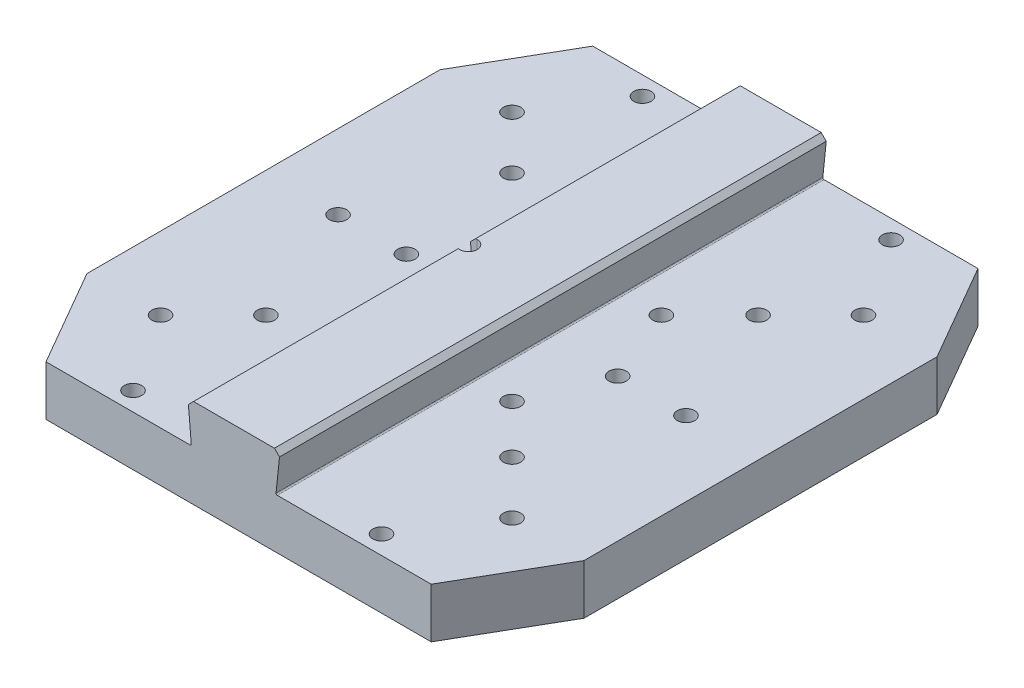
ISO-10303-21;
HEADER;
FILE_DESCRIPTION(('STEP AP214'),'2;1');
FILE_NAME('part.step','',(''),(''),'','','');
FILE_SCHEMA(('AUTOMOTIVE_DESIGN { 1 0 10303 214 1 1 1 1 }'));
ENDSEC;
DATA;
#1=APPLICATION_CONTEXT('core data for automotive mechanical design processes');
#2=APPLICATION_PROTOCOL_DEFINITION('international standard','automotive_design',2000,#1);
#3=PRODUCT_CONTEXT('',#1,'mechanical');
#4=PRODUCT('Part','Part','',(#3));
#5=PRODUCT_RELATED_PRODUCT_CATEGORY('part','',(#4));
#6=PRODUCT_DEFINITION_FORMATION('','',#4);
#7=PRODUCT_DEFINITION_CONTEXT('part definition',#1,'design');
#8=PRODUCT_DEFINITION('design','',#6,#7);
#9=PRODUCT_DEFINITION_SHAPE('','',#8);
#10=(LENGTH_UNIT() NAMED_UNIT(*) SI_UNIT(.MILLI.,.METRE.));
#11=(NAMED_UNIT(*) PLANE_ANGLE_UNIT() SI_UNIT($,.RADIAN.));
#12=(NAMED_UNIT(*) SI_UNIT($,.STERADIAN.) SOLID_ANGLE_UNIT());
#13=UNCERTAINTY_MEASURE_WITH_UNIT(LENGTH_MEASURE(1.E-05),#10,'distance_accuracy_value','');
#14=(GEOMETRIC_REPRESENTATION_CONTEXT(3) GLOBAL_UNCERTAINTY_ASSIGNED_CONTEXT((#13)) GLOBAL_UNIT_ASSIGNED_CONTEXT((#10,
#11,#12)) REPRESENTATION_CONTEXT('',''));
#15=CARTESIAN_POINT('',(0.,0.,0.));
#16=DIRECTION('',(0.,0.,1.));
#17=DIRECTION('',(1.,0.,0.));
#18=AXIS2_PLACEMENT_3D('',#15,#16,#17);
#19=CARTESIAN_POINT('',(-38.,0.,300.60068182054));
#20=DIRECTION('',(0.996194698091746,0.0871557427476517,0.));
#21=DIRECTION('',(-0.0871557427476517,0.996194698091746,0.));
#22=AXIS2_PLACEMENT_3D('',#19,#20,#21);
#23=PLANE('',#22);
#24=DIRECTION('',(0.0871557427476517,-0.996194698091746,0.));
#25=VECTOR('',#24,1.);
#26=CARTESIAN_POINT('',(-38.,0.,7.00000000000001));
#27=LINE('',#26,#25);
#28=CARTESIAN_POINT('',(-40.4113648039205,27.5620258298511,7.00000000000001));
#29=VERTEX_POINT('',#28);
#30=CARTESIAN_POINT('',(-38.0951138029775,1.08715574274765,7.00000000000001));
#31=VERTEX_POINT('',#30);
#32=EDGE_CURVE('E634',#29,#31,#27,.T.);
#33=ORIENTED_EDGE('',*,*,#32,.T.);
#34=DIRECTION('',(0.,0.,-1.));
#35=VECTOR('',#34,1.);
#36=CARTESIAN_POINT('',(-38.0951138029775,1.08715574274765,220.));
#37=LINE('',#36,#35);
#38=CARTESIAN_POINT('',(-38.0951138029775,1.08715574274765,220.));
#39=VERTEX_POINT('',#38);
#40=EDGE_CURVE('E590',#31,#39,#37,.F.);
#41=ORIENTED_EDGE('',*,*,#40,.T.);
#42=DIRECTION('',(0.0871557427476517,-0.996194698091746,0.));
#43=VECTOR('',#42,1.);
#44=CARTESIAN_POINT('',(-38.,0.,220.));
#45=LINE('',#44,#43);
#46=CARTESIAN_POINT('',(-40.4113648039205,27.5620258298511,220.));
#47=VERTEX_POINT('',#46);
#48=EDGE_CURVE('E583',#47,#39,#45,.T.);
#49=ORIENTED_EDGE('',*,*,#48,.F.);
#50=DIRECTION('',(0.,0.,-1.));
#51=VECTOR('',#50,1.);
#52=CARTESIAN_POINT('',(-40.4113648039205,27.5620258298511,300.60068182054));
#53=LINE('',#52,#51);
#54=EDGE_CURVE('E609',#47,#29,#53,.T.);
#55=ORIENTED_EDGE('',*,*,#54,.T.);
#56=EDGE_LOOP('',(#33,#41,#49,#55));
#57=FACE_BOUND('',#56,.T.);
#58=ADVANCED_FACE('F39',(#57),#23,.F.);
#59=CARTESIAN_POINT('',(0.,0.,0.));
#60=DIRECTION('',(0.,-1.,0.));
#61=DIRECTION('',(0.,0.,-1.));
#62=AXIS2_PLACEMENT_3D('',#59,#60,#61);
#63=PLANE('',#62);
#64=CARTESIAN_POINT('',(100.,0.,205.));
#65=DIRECTION('',(0.,-1.,0.));
#66=DIRECTION('',(0.,0.,-1.));
#67=AXIS2_PLACEMENT_3D('',#64,#65,#66);
#68=CIRCLE('',#67,6.99999999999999);
#69=CARTESIAN_POINT('',(100.,0.,198.));
#70=VERTEX_POINT('',#69);
#71=EDGE_CURVE('E43',#70,#70,#68,.T.);
#72=ORIENTED_EDGE('',*,*,#71,.T.);
#73=EDGE_LOOP('',(#72));
#74=FACE_BOUND('',#73,.T.);
#75=CARTESIAN_POINT('',(141.42135623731,0.,141.421356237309));
#76=DIRECTION('',(0.,-1.,0.));
#77=DIRECTION('',(0.,0.,-1.));
#78=AXIS2_PLACEMENT_3D('',#75,#76,#77);
#79=CIRCLE('',#78,6.99999999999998);
#80=CARTESIAN_POINT('',(141.42135623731,0.,134.421356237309));
#81=VERTEX_POINT('',#80);
#82=EDGE_CURVE('E279',#81,#81,#79,.T.);
#83=ORIENTED_EDGE('',*,*,#82,.T.);
#84=EDGE_LOOP('',(#83));
#85=FACE_BOUND('',#84,.T.);
#86=CARTESIAN_POINT('',(98.9949493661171,0.,98.9949493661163));
#87=DIRECTION('',(0.,-1.,0.));
#88=DIRECTION('',(0.,0.,-1.));
#89=AXIS2_PLACEMENT_3D('',#86,#87,#88);
#90=CIRCLE('',#89,6.99999999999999);
#91=CARTESIAN_POINT('',(98.9949493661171,0.,91.9949493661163));
#92=VERTEX_POINT('',#91);
#93=EDGE_CURVE('E286',#92,#92,#90,.T.);
#94=ORIENTED_EDGE('',*,*,#93,.T.);
#95=EDGE_LOOP('',(#94));
#96=FACE_BOUND('',#95,.T.);
#97=CARTESIAN_POINT('',(60.1040764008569,0.,60.1040764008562));
#98=DIRECTION('',(0.,-1.,0.));
#99=DIRECTION('',(0.,0.,-1.));
#100=AXIS2_PLACEMENT_3D('',#97,#98,#99);
#101=CIRCLE('',#100,6.99999999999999);
#102=CARTESIAN_POINT('',(60.1040764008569,0.,53.1040764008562));
#103=VERTEX_POINT('',#102);
#104=EDGE_CURVE('E293',#103,#103,#101,.T.);
#105=ORIENTED_EDGE('',*,*,#104,.T.);
#106=EDGE_LOOP('',(#105));
#107=FACE_BOUND('',#106,.T.);
#108=CARTESIAN_POINT('',(85.,0.,0.));
#109=DIRECTION('',(0.,-1.,0.));
#110=DIRECTION('',(0.,0.,-1.));
#111=AXIS2_PLACEMENT_3D('',#108,#109,#110);
#112=CIRCLE('',#111,6.99999999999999);
#113=CARTESIAN_POINT('',(85.,0.,-6.99999999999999));
#114=VERTEX_POINT('',#113);
#115=EDGE_CURVE('E300',#114,#114,#112,.T.);
#116=ORIENTED_EDGE('',*,*,#115,.T.);
#117=EDGE_LOOP('',(#116));
#118=FACE_BOUND('',#117,.T.);
#119=CARTESIAN_POINT('',(140.,0.,0.));
#120=DIRECTION('',(0.,-1.,0.));
#121=DIRECTION('',(0.,0.,-1.));
#122=AXIS2_PLACEMENT_3D('',#119,#120,#121);
#123=CIRCLE('',#122,6.99999999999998);
#124=CARTESIAN_POINT('',(140.,0.,-6.99999999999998));
#125=VERTEX_POINT('',#124);
#126=EDGE_CURVE('E307',#125,#125,#123,.T.);
#127=ORIENTED_EDGE('',*,*,#126,.T.);
#128=EDGE_LOOP('',(#127));
#129=FACE_BOUND('',#128,.T.);
#130=CARTESIAN_POINT('',(60.1040764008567,0.,-60.1040764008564));
#131=DIRECTION('',(0.,-1.,0.));
#132=DIRECTION('',(0.,0.,-1.));
#133=AXIS2_PLACEMENT_3D('',#130,#131,#132);
#134=CIRCLE('',#133,6.99999999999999);
#135=CARTESIAN_POINT('',(60.1040764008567,0.,-67.1040764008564));
#136=VERTEX_POINT('',#135);
#137=EDGE_CURVE('E314',#136,#136,#134,.T.);
#138=ORIENTED_EDGE('',*,*,#137,.T.);
#139=EDGE_LOOP('',(#138));
#140=FACE_BOUND('',#139,.T.);
#141=CARTESIAN_POINT('',(98.9949493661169,0.,-98.9949493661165));
#142=DIRECTION('',(0.,-1.,0.));
#143=DIRECTION('',(0.,0.,-1.));
#144=AXIS2_PLACEMENT_3D('',#141,#142,#143);
#145=CIRCLE('',#144,6.99999999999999);
#146=CARTESIAN_POINT('',(98.9949493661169,0.,-105.994949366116));
#147=VERTEX_POINT('',#146);
#148=EDGE_CURVE('E321',#147,#147,#145,.T.);
#149=ORIENTED_EDGE('',*,*,#148,.T.);
#150=EDGE_LOOP('',(#149));
#151=FACE_BOUND('',#150,.T.);
#152=CARTESIAN_POINT('',(141.42135623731,0.,-141.421356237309));
#153=DIRECTION('',(0.,-1.,0.));
#154=DIRECTION('',(0.,0.,-1.));
#155=AXIS2_PLACEMENT_3D('',#152,#153,#154);
#156=CIRCLE('',#155,6.99999999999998);
#157=CARTESIAN_POINT('',(141.42135623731,0.,-148.421356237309));
#158=VERTEX_POINT('',#157);
#159=EDGE_CURVE('E328',#158,#158,#156,.T.);
#160=ORIENTED_EDGE('',*,*,#159,.T.);
#161=EDGE_LOOP('',(#160));
#162=FACE_BOUND('',#161,.T.);
#163=CARTESIAN_POINT('',(100.,0.,-205.));
#164=DIRECTION('',(0.,-1.,0.));
#165=DIRECTION('',(0.,0.,-1.));
#166=AXIS2_PLACEMENT_3D('',#163,#164,#165);
#167=CIRCLE('',#166,6.99999999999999);
#168=CARTESIAN_POINT('',(100.,0.,-212.));
#169=VERTEX_POINT('',#168);
#170=EDGE_CURVE('E335',#169,#169,#167,.T.);
#171=ORIENTED_EDGE('',*,*,#170,.T.);
#172=EDGE_LOOP('',(#171));
#173=FACE_BOUND('',#172,.T.);
#174=DIRECTION('',(-1.,0.,0.));
#175=VECTOR('',#174,1.);
#176=CARTESIAN_POINT('',(-200.,0.,-220.));
#177=LINE('',#176,#175);
#178=CARTESIAN_POINT('',(155.,0.,-220.));
#179=VERTEX_POINT('',#178);
#180=CARTESIAN_POINT('',(31.1106125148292,0.,-220.));
#181=VERTEX_POINT('',#180);
#182=EDGE_CURVE('E462',#179,#181,#177,.T.);
#183=ORIENTED_EDGE('',*,*,#182,.T.);
#184=DIRECTION('',(0.,0.,-1.));
#185=VECTOR('',#184,1.);
#186=CARTESIAN_POINT('',(31.1106125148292,0.,220.));
#187=LINE('',#186,#185);
#188=CARTESIAN_POINT('',(31.1106125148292,0.,220.));
#189=VERTEX_POINT('',#188);
#190=EDGE_CURVE('E62',#181,#189,#187,.F.);
#191=ORIENTED_EDGE('',*,*,#190,.T.);
#192=DIRECTION('',(1.,0.,0.));
#193=VECTOR('',#192,1.);
#194=CARTESIAN_POINT('',(-200.,0.,220.));
#195=LINE('',#194,#193);
#196=CARTESIAN_POINT('',(155.,0.,220.));
#197=VERTEX_POINT('',#196);
#198=EDGE_CURVE('E469',#189,#197,#195,.T.);
#199=ORIENTED_EDGE('',*,*,#198,.T.);
#200=DIRECTION('',(-0.500000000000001,0.,0.866025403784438));
#201=VECTOR('',#200,1.);
#202=CARTESIAN_POINT('',(155.,0.,220.));
#203=LINE('',#202,#201);
#204=CARTESIAN_POINT('',(200.,0.,142.057713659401));
#205=VERTEX_POINT('',#204);
#206=EDGE_CURVE('E675',#197,#205,#203,.F.);
#207=ORIENTED_EDGE('',*,*,#206,.T.);
#208=DIRECTION('',(0.,0.,-1.));
#209=VECTOR('',#208,1.);
#210=CARTESIAN_POINT('',(200.,0.,220.));
#211=LINE('',#210,#209);
#212=CARTESIAN_POINT('',(200.,0.,-142.057713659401));
#213=VERTEX_POINT('',#212);
#214=EDGE_CURVE('E434',#205,#213,#211,.T.);
#215=ORIENTED_EDGE('',*,*,#214,.T.);
#216=DIRECTION('',(0.500000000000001,0.,0.866025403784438));
#217=VECTOR('',#216,1.);
#218=CARTESIAN_POINT('',(200.,0.,-142.057713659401));
#219=LINE('',#218,#217);
#220=EDGE_CURVE('E685',#213,#179,#219,.F.);
#221=ORIENTED_EDGE('',*,*,#220,.T.);
#222=EDGE_LOOP('',(#183,#191,#199,#207,#215,#221));
#223=FACE_BOUND('',#222,.T.);
#224=ADVANCED_FACE('F530',(#74,#85,#96,#107,#118,#129,#140,#151,#162,#173,#223),#63,.F.);
#225=CARTESIAN_POINT('',(200.,-40.2,220.));
#226=DIRECTION('',(1.,0.,0.));
#227=DIRECTION('',(0.,0.,-1.));
#228=AXIS2_PLACEMENT_3D('',#225,#226,#227);
#229=PLANE('',#228);
#230=DIRECTION('',(0.,0.,-1.));
#231=VECTOR('',#230,1.);
#232=CARTESIAN_POINT('',(200.,-40.2,220.));
#233=LINE('',#232,#231);
#234=CARTESIAN_POINT('',(200.,-40.2,142.057713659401));
#235=VERTEX_POINT('',#234);
#236=CARTESIAN_POINT('',(200.,-40.2,-142.0577136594));
#237=VERTEX_POINT('',#236);
#238=EDGE_CURVE('E436',#235,#237,#233,.T.);
#239=ORIENTED_EDGE('',*,*,#238,.T.);
#240=DIRECTION('',(0.,1.,0.));
#241=VECTOR('',#240,1.);
#242=CARTESIAN_POINT('',(200.,-40.2,-142.057713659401));
#243=LINE('',#242,#241);
#244=EDGE_CURVE('E706',#237,#213,#243,.T.);
#245=ORIENTED_EDGE('',*,*,#244,.T.);
#246=ORIENTED_EDGE('',*,*,#214,.F.);
#247=DIRECTION('',(0.,-1.,0.));
#248=VECTOR('',#247,1.);
#249=CARTESIAN_POINT('',(200.,-40.2,142.057713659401));
#250=LINE('',#249,#248);
#251=EDGE_CURVE('E681',#205,#235,#250,.T.);
#252=ORIENTED_EDGE('',*,*,#251,.T.);
#253=EDGE_LOOP('',(#239,#245,#246,#252));
#254=FACE_BOUND('',#253,.T.);
#255=ADVANCED_FACE('F556',(#254),#229,.T.);
#256=CARTESIAN_POINT('',(-200.,-40.2,220.));
#257=DIRECTION('',(0.,0.,1.));
#258=DIRECTION('',(1.,0.,0.));
#259=AXIS2_PLACEMENT_3D('',#256,#257,#258);
#260=PLANE('',#259);
#261=DIRECTION('',(-1.,0.,0.));
#262=VECTOR('',#261,1.);
#263=CARTESIAN_POINT('',(-40.7733906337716,31.7,220.));
#264=LINE('',#263,#262);
#265=CARTESIAN_POINT('',(28.8318042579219,31.7,220.));
#266=VERTEX_POINT('',#265);
#267=CARTESIAN_POINT('',(-36.2733906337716,31.7,220.));
#268=VERTEX_POINT('',#267);
#269=EDGE_CURVE('E431',#266,#268,#264,.T.);
#270=ORIENTED_EDGE('',*,*,#269,.T.);
#271=DIRECTION('',(0.707106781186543,0.707106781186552,0.));
#272=VECTOR('',#271,1.);
#273=CARTESIAN_POINT('',(-154.086695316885,-86.1133046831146,220.));
#274=LINE('',#273,#272);
#275=EDGE_CURVE('E616',#268,#47,#274,.F.);
#276=ORIENTED_EDGE('',*,*,#275,.T.);
#277=ORIENTED_EDGE('',*,*,#48,.T.);
#278=CARTESIAN_POINT('',(-39.0913085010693,1.,220.));
#279=DIRECTION('',(0.,0.,1.));
#280=DIRECTION('',(1.,0.,0.));
#281=AXIS2_PLACEMENT_3D('',#278,#279,#280);
#282=CIRCLE('',#281,1.);
#283=CARTESIAN_POINT('',(-39.0913085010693,0.,220.));
#284=VERTEX_POINT('',#283);
#285=EDGE_CURVE('E489',#39,#284,#282,.F.);
#286=ORIENTED_EDGE('',*,*,#285,.T.);
#287=CARTESIAN_POINT('',(-155.,0.,220.));
#288=VERTEX_POINT('',#287);
#289=EDGE_CURVE('E440',#288,#284,#195,.T.);
#290=ORIENTED_EDGE('',*,*,#289,.F.);
#291=DIRECTION('',(0.,-1.,0.));
#292=VECTOR('',#291,1.);
#293=CARTESIAN_POINT('',(-155.,-40.2,220.));
#294=LINE('',#293,#292);
#295=CARTESIAN_POINT('',(-155.,-40.2,220.));
#296=VERTEX_POINT('',#295);
#297=EDGE_CURVE('E465',#288,#296,#294,.T.);
#298=ORIENTED_EDGE('',*,*,#297,.T.);
#299=DIRECTION('',(1.,0.,0.));
#300=VECTOR('',#299,1.);
#301=CARTESIAN_POINT('',(-200.,-40.2,220.));
#302=LINE('',#301,#300);
#303=CARTESIAN_POINT('',(155.,-40.2,220.));
#304=VERTEX_POINT('',#303);
#305=EDGE_CURVE('E446',#296,#304,#302,.T.);
#306=ORIENTED_EDGE('',*,*,#305,.T.);
#307=DIRECTION('',(0.,1.,0.));
#308=VECTOR('',#307,1.);
#309=CARTESIAN_POINT('',(155.,-40.2,220.));
#310=LINE('',#309,#308);
#311=EDGE_CURVE('E673',#304,#197,#310,.T.);
#312=ORIENTED_EDGE('',*,*,#311,.T.);
#313=ORIENTED_EDGE('',*,*,#198,.F.);
#314=CARTESIAN_POINT('',(31.1106125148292,1.,220.));
#315=DIRECTION('',(0.,0.,1.));
#316=DIRECTION('',(1.,0.,0.));
#317=AXIS2_PLACEMENT_3D('',#314,#315,#316);
#318=CIRCLE('',#317,1.);
#319=CARTESIAN_POINT('',(30.1160906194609,1.10452846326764,220.));
#320=VERTEX_POINT('',#319);
#321=EDGE_CURVE('E11',#189,#320,#318,.F.);
#322=ORIENTED_EDGE('',*,*,#321,.T.);
#323=DIRECTION('',(0.104528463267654,0.994521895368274,0.));
#324=VECTOR('',#323,1.);
#325=CARTESIAN_POINT('',(33.3318042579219,31.7,220.));
#326=LINE('',#325,#324);
#327=CARTESIAN_POINT('',(32.9038183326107,27.6279859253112,220.));
#328=VERTEX_POINT('',#327);
#329=EDGE_CURVE('E435',#320,#328,#326,.T.);
#330=ORIENTED_EDGE('',*,*,#329,.T.);
#331=DIRECTION('',(0.707106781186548,-0.707106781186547,0.));
#332=VECTOR('',#331,1.);
#333=CARTESIAN_POINT('',(-49.6340978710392,110.165902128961,220.));
#334=LINE('',#333,#332);
#335=EDGE_CURVE('E614',#328,#266,#334,.F.);
#336=ORIENTED_EDGE('',*,*,#335,.T.);
#337=EDGE_LOOP('',(#270,#276,#277,#286,#290,#298,#306,#312,#313,#322,#330,#336));
#338=FACE_BOUND('',#337,.T.);
#339=ADVANCED_FACE('F670',(#338),#260,.T.);
#340=CARTESIAN_POINT('',(-200.,-40.2,220.));
#341=DIRECTION('',(-1.,0.,0.));
#342=DIRECTION('',(0.,0.,1.));
#343=AXIS2_PLACEMENT_3D('',#340,#341,#342);
#344=PLANE('',#343);
#345=DIRECTION('',(0.,0.,1.));
#346=VECTOR('',#345,1.);
#347=CARTESIAN_POINT('',(-200.,0.,220.));
#348=LINE('',#347,#346);
#349=CARTESIAN_POINT('',(-200.,0.,-142.057713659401));
#350=VERTEX_POINT('',#349);
#351=CARTESIAN_POINT('',(-200.,0.,142.057713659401));
#352=VERTEX_POINT('',#351);
#353=EDGE_CURVE('E455',#350,#352,#348,.T.);
#354=ORIENTED_EDGE('',*,*,#353,.F.);
#355=DIRECTION('',(0.,-1.,0.));
#356=VECTOR('',#355,1.);
#357=CARTESIAN_POINT('',(-200.,-40.2,-142.057713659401));
#358=LINE('',#357,#356);
#359=CARTESIAN_POINT('',(-200.,-40.2,-142.0577136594));
#360=VERTEX_POINT('',#359);
#361=EDGE_CURVE('E695',#350,#360,#358,.T.);
#362=ORIENTED_EDGE('',*,*,#361,.T.);
#363=DIRECTION('',(0.,0.,1.));
#364=VECTOR('',#363,1.);
#365=CARTESIAN_POINT('',(-200.,-40.2,220.));
#366=LINE('',#365,#364);
#367=CARTESIAN_POINT('',(-200.,-40.2,142.057713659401));
#368=VERTEX_POINT('',#367);
#369=EDGE_CURVE('E443',#360,#368,#366,.T.);
#370=ORIENTED_EDGE('',*,*,#369,.T.);
#371=DIRECTION('',(0.,1.,0.));
#372=VECTOR('',#371,1.);
#373=CARTESIAN_POINT('',(-200.,-40.2,142.057713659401));
#374=LINE('',#373,#372);
#375=EDGE_CURVE('E692',#368,#352,#374,.T.);
#376=ORIENTED_EDGE('',*,*,#375,.T.);
#377=EDGE_LOOP('',(#354,#362,#370,#376));
#378=FACE_BOUND('',#377,.T.);
#379=ADVANCED_FACE('F721',(#378),#344,.T.);
#380=CARTESIAN_POINT('',(-200.,-40.2,-220.));
#381=DIRECTION('',(0.,0.,-1.));
#382=DIRECTION('',(-1.,0.,0.));
#383=AXIS2_PLACEMENT_3D('',#380,#381,#382);
#384=PLANE('',#383);
#385=DIRECTION('',(0.0871557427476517,-0.996194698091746,0.));
#386=VECTOR('',#385,1.);
#387=CARTESIAN_POINT('',(-38.,0.,-220.));
#388=LINE('',#387,#386);
#389=CARTESIAN_POINT('',(-40.4113648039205,27.5620258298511,-220.));
#390=VERTEX_POINT('',#389);
#391=CARTESIAN_POINT('',(-38.0951138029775,1.08715574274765,-220.));
#392=VERTEX_POINT('',#391);
#393=EDGE_CURVE('E430',#390,#392,#388,.T.);
#394=ORIENTED_EDGE('',*,*,#393,.F.);
#395=DIRECTION('',(-0.707106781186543,-0.707106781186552,0.));
#396=VECTOR('',#395,1.);
#397=CARTESIAN_POINT('',(-154.086695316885,-86.1133046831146,-220.));
#398=LINE('',#397,#396);
#399=CARTESIAN_POINT('',(-36.2733906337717,31.7,-220.));
#400=VERTEX_POINT('',#399);
#401=EDGE_CURVE('E645',#390,#400,#398,.F.);
#402=ORIENTED_EDGE('',*,*,#401,.T.);
#403=DIRECTION('',(-1.,0.,0.));
#404=VECTOR('',#403,1.);
#405=CARTESIAN_POINT('',(-40.7733906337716,31.7,-220.));
#406=LINE('',#405,#404);
#407=CARTESIAN_POINT('',(28.8318042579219,31.7,-220.));
#408=VERTEX_POINT('',#407);
#409=EDGE_CURVE('E427',#408,#400,#406,.T.);
#410=ORIENTED_EDGE('',*,*,#409,.F.);
#411=DIRECTION('',(-0.707106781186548,0.707106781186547,0.));
#412=VECTOR('',#411,1.);
#413=CARTESIAN_POINT('',(-49.6340978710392,110.165902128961,-220.));
#414=LINE('',#413,#412);
#415=CARTESIAN_POINT('',(32.9038183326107,27.6279859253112,-220.));
#416=VERTEX_POINT('',#415);
#417=EDGE_CURVE('E640',#408,#416,#414,.F.);
#418=ORIENTED_EDGE('',*,*,#417,.T.);
#419=DIRECTION('',(0.104528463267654,0.994521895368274,0.));
#420=VECTOR('',#419,1.);
#421=CARTESIAN_POINT('',(33.3318042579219,31.7,-220.));
#422=LINE('',#421,#420);
#423=CARTESIAN_POINT('',(30.1160906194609,1.10452846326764,-220.));
#424=VERTEX_POINT('',#423);
#425=EDGE_CURVE('E419',#424,#416,#422,.T.);
#426=ORIENTED_EDGE('',*,*,#425,.F.);
#427=CARTESIAN_POINT('',(31.1106125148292,1.,-220.));
#428=DIRECTION('',(0.,0.,-1.));
#429=DIRECTION('',(-1.,0.,0.));
#430=AXIS2_PLACEMENT_3D('',#427,#428,#429);
#431=CIRCLE('',#430,1.);
#432=EDGE_CURVE('E48',#424,#181,#431,.F.);
#433=ORIENTED_EDGE('',*,*,#432,.T.);
#434=ORIENTED_EDGE('',*,*,#182,.F.);
#435=DIRECTION('',(0.,-1.,0.));
#436=VECTOR('',#435,1.);
#437=CARTESIAN_POINT('',(155.,-40.2,-220.));
#438=LINE('',#437,#436);
#439=CARTESIAN_POINT('',(155.,-40.2,-220.));
#440=VERTEX_POINT('',#439);
#441=EDGE_CURVE('E449',#179,#440,#438,.T.);
#442=ORIENTED_EDGE('',*,*,#441,.T.);
#443=DIRECTION('',(-1.,0.,0.));
#444=VECTOR('',#443,1.);
#445=CARTESIAN_POINT('',(-200.,-40.2,-220.));
#446=LINE('',#445,#444);
#447=CARTESIAN_POINT('',(-155.,-40.2,-220.));
#448=VERTEX_POINT('',#447);
#449=EDGE_CURVE('E439',#440,#448,#446,.T.);
#450=ORIENTED_EDGE('',*,*,#449,.T.);
#451=DIRECTION('',(0.,1.,0.));
#452=VECTOR('',#451,1.);
#453=CARTESIAN_POINT('',(-155.,-40.2,-220.));
#454=LINE('',#453,#452);
#455=CARTESIAN_POINT('',(-155.,0.,-220.));
#456=VERTEX_POINT('',#455);
#457=EDGE_CURVE('E683',#448,#456,#454,.T.);
#458=ORIENTED_EDGE('',*,*,#457,.T.);
#459=CARTESIAN_POINT('',(-39.0913085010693,0.,-220.));
#460=VERTEX_POINT('',#459);
#461=EDGE_CURVE('E452',#460,#456,#177,.T.);
#462=ORIENTED_EDGE('',*,*,#461,.F.);
#463=CARTESIAN_POINT('',(-39.0913085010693,1.,-220.));
#464=DIRECTION('',(0.,0.,-1.));
#465=DIRECTION('',(-1.,0.,0.));
#466=AXIS2_PLACEMENT_3D('',#463,#464,#465);
#467=CIRCLE('',#466,1.);
#468=EDGE_CURVE('E482',#460,#392,#467,.F.);
#469=ORIENTED_EDGE('',*,*,#468,.T.);
#470=EDGE_LOOP('',(#394,#402,#410,#418,#426,#433,#434,#442,#450,#458,#462,#469));
#471=FACE_BOUND('',#470,.T.);
#472=ADVANCED_FACE('F660',(#471),#384,.T.);
#473=CARTESIAN_POINT('',(0.,-40.2,0.));
#474=DIRECTION('',(0.,-1.,0.));
#475=DIRECTION('',(0.,0.,-1.));
#476=AXIS2_PLACEMENT_3D('',#473,#474,#475);
#477=PLANE('',#476);
#478=CARTESIAN_POINT('',(0.,-40.2,200.));
#479=DIRECTION('',(0.,-1.,0.));
#480=DIRECTION('',(0.,0.,-1.));
#481=AXIS2_PLACEMENT_3D('',#478,#479,#480);
#482=CIRCLE('',#481,8.025);
#483=CARTESIAN_POINT('',(0.,-40.2,191.975));
#484=VERTEX_POINT('',#483);
#485=EDGE_CURVE('E222',#484,#484,#482,.T.);
#486=ORIENTED_EDGE('',*,*,#485,.F.);
#487=EDGE_LOOP('',(#486));
#488=FACE_BOUND('',#487,.T.);
#489=CARTESIAN_POINT('',(0.,-40.2,140.));
#490=DIRECTION('',(0.,-1.,0.));
#491=DIRECTION('',(0.,0.,-1.));
#492=AXIS2_PLACEMENT_3D('',#489,#490,#491);
#493=CIRCLE('',#492,8.025);
#494=CARTESIAN_POINT('',(0.,-40.2,131.975));
#495=VERTEX_POINT('',#494);
#496=EDGE_CURVE('E215',#495,#495,#493,.T.);
#497=ORIENTED_EDGE('',*,*,#496,.F.);
#498=EDGE_LOOP('',(#497));
#499=FACE_BOUND('',#498,.T.);
#500=CARTESIAN_POINT('',(0.,-40.2,85.));
#501=DIRECTION('',(0.,-1.,0.));
#502=DIRECTION('',(0.,0.,-1.));
#503=AXIS2_PLACEMENT_3D('',#500,#501,#502);
#504=CIRCLE('',#503,8.025);
#505=CARTESIAN_POINT('',(0.,-40.2,76.975));
#506=VERTEX_POINT('',#505);
#507=EDGE_CURVE('E231',#506,#506,#504,.T.);
#508=ORIENTED_EDGE('',*,*,#507,.F.);
#509=EDGE_LOOP('',(#508));
#510=FACE_BOUND('',#509,.T.);
#511=CARTESIAN_POINT('',(0.,-40.2,-85.));
#512=DIRECTION('',(0.,-1.,0.));
#513=DIRECTION('',(0.,0.,-1.));
#514=AXIS2_PLACEMENT_3D('',#511,#512,#513);
#515=CIRCLE('',#514,8.025);
#516=CARTESIAN_POINT('',(0.,-40.2,-93.025));
#517=VERTEX_POINT('',#516);
#518=EDGE_CURVE('E240',#517,#517,#515,.T.);
#519=ORIENTED_EDGE('',*,*,#518,.F.);
#520=EDGE_LOOP('',(#519));
#521=FACE_BOUND('',#520,.T.);
#522=CARTESIAN_POINT('',(0.,-40.2,-140.));
#523=DIRECTION('',(0.,-1.,0.));
#524=DIRECTION('',(0.,0.,-1.));
#525=AXIS2_PLACEMENT_3D('',#522,#523,#524);
#526=CIRCLE('',#525,8.025);
#527=CARTESIAN_POINT('',(0.,-40.2,-148.025));
#528=VERTEX_POINT('',#527);
#529=EDGE_CURVE('E249',#528,#528,#526,.T.);
#530=ORIENTED_EDGE('',*,*,#529,.F.);
#531=EDGE_LOOP('',(#530));
#532=FACE_BOUND('',#531,.T.);
#533=CARTESIAN_POINT('',(0.,-40.2,-200.));
#534=DIRECTION('',(0.,-1.,0.));
#535=DIRECTION('',(0.,0.,-1.));
#536=AXIS2_PLACEMENT_3D('',#533,#534,#535);
#537=CIRCLE('',#536,8.025);
#538=CARTESIAN_POINT('',(0.,-40.2,-208.025));
#539=VERTEX_POINT('',#538);
#540=EDGE_CURVE('E258',#539,#539,#537,.T.);
#541=ORIENTED_EDGE('',*,*,#540,.F.);
#542=EDGE_LOOP('',(#541));
#543=FACE_BOUND('',#542,.T.);
#544=CARTESIAN_POINT('',(100.,-40.2,205.));
#545=DIRECTION('',(0.,-1.,0.));
#546=DIRECTION('',(0.,0.,-1.));
#547=AXIS2_PLACEMENT_3D('',#544,#545,#546);
#548=CIRCLE('',#547,8.025);
#549=CARTESIAN_POINT('',(100.,-40.2,196.975));
#550=VERTEX_POINT('',#549);
#551=EDGE_CURVE('E267',#550,#550,#548,.T.);
#552=ORIENTED_EDGE('',*,*,#551,.F.);
#553=EDGE_LOOP('',(#552));
#554=FACE_BOUND('',#553,.T.);
#555=CARTESIAN_POINT('',(141.42135623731,-40.2,141.421356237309));
#556=DIRECTION('',(0.,-1.,0.));
#557=DIRECTION('',(0.,0.,-1.));
#558=AXIS2_PLACEMENT_3D('',#555,#556,#557);
#559=CIRCLE('',#558,8.025);
#560=CARTESIAN_POINT('',(141.42135623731,-40.2,133.396356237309));
#561=VERTEX_POINT('',#560);
#562=EDGE_CURVE('E273',#561,#561,#559,.T.);
#563=ORIENTED_EDGE('',*,*,#562,.F.);
#564=EDGE_LOOP('',(#563));
#565=FACE_BOUND('',#564,.T.);
#566=CARTESIAN_POINT('',(98.9949493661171,-40.2,98.9949493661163));
#567=DIRECTION('',(0.,-1.,0.));
#568=DIRECTION('',(0.,0.,-1.));
#569=AXIS2_PLACEMENT_3D('',#566,#567,#568);
#570=CIRCLE('',#569,8.025);
#571=CARTESIAN_POINT('',(98.9949493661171,-40.2,90.9699493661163));
#572=VERTEX_POINT('',#571);
#573=EDGE_CURVE('E280',#572,#572,#570,.T.);
#574=ORIENTED_EDGE('',*,*,#573,.F.);
#575=EDGE_LOOP('',(#574));
#576=FACE_BOUND('',#575,.T.);
#577=CARTESIAN_POINT('',(60.1040764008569,-40.2,60.1040764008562));
#578=DIRECTION('',(0.,-1.,0.));
#579=DIRECTION('',(0.,0.,-1.));
#580=AXIS2_PLACEMENT_3D('',#577,#578,#579);
#581=CIRCLE('',#580,8.025);
#582=CARTESIAN_POINT('',(60.1040764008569,-40.2,52.0790764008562));
#583=VERTEX_POINT('',#582);
#584=EDGE_CURVE('E287',#583,#583,#581,.T.);
#585=ORIENTED_EDGE('',*,*,#584,.F.);
#586=EDGE_LOOP('',(#585));
#587=FACE_BOUND('',#586,.T.);
#588=CARTESIAN_POINT('',(85.,-40.2,0.));
#589=DIRECTION('',(0.,-1.,0.));
#590=DIRECTION('',(0.,0.,-1.));
#591=AXIS2_PLACEMENT_3D('',#588,#589,#590);
#592=CIRCLE('',#591,8.025);
#593=CARTESIAN_POINT('',(85.,-40.2,-8.025));
#594=VERTEX_POINT('',#593);
#595=EDGE_CURVE('E294',#594,#594,#592,.T.);
#596=ORIENTED_EDGE('',*,*,#595,.F.);
#597=EDGE_LOOP('',(#596));
#598=FACE_BOUND('',#597,.T.);
#599=CARTESIAN_POINT('',(140.,-40.2,0.));
#600=DIRECTION('',(0.,-1.,0.));
#601=DIRECTION('',(0.,0.,-1.));
#602=AXIS2_PLACEMENT_3D('',#599,#600,#601);
#603=CIRCLE('',#602,8.025);
#604=CARTESIAN_POINT('',(140.,-40.2,-8.025));
#605=VERTEX_POINT('',#604);
#606=EDGE_CURVE('E301',#605,#605,#603,.T.);
#607=ORIENTED_EDGE('',*,*,#606,.F.);
#608=EDGE_LOOP('',(#607));
#609=FACE_BOUND('',#608,.T.);
#610=CARTESIAN_POINT('',(60.1040764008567,-40.2,-60.1040764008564));
#611=DIRECTION('',(0.,-1.,0.));
#612=DIRECTION('',(0.,0.,-1.));
#613=AXIS2_PLACEMENT_3D('',#610,#611,#612);
#614=CIRCLE('',#613,8.025);
#615=CARTESIAN_POINT('',(60.1040764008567,-40.2,-68.1290764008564));
#616=VERTEX_POINT('',#615);
#617=EDGE_CURVE('E308',#616,#616,#614,.T.);
#618=ORIENTED_EDGE('',*,*,#617,.F.);
#619=EDGE_LOOP('',(#618));
#620=FACE_BOUND('',#619,.T.);
#621=CARTESIAN_POINT('',(98.9949493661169,-40.2,-98.9949493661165));
#622=DIRECTION('',(0.,-1.,0.));
#623=DIRECTION('',(0.,0.,-1.));
#624=AXIS2_PLACEMENT_3D('',#621,#622,#623);
#625=CIRCLE('',#624,8.025);
#626=CARTESIAN_POINT('',(98.9949493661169,-40.2,-107.019949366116));
#627=VERTEX_POINT('',#626);
#628=EDGE_CURVE('E315',#627,#627,#625,.T.);
#629=ORIENTED_EDGE('',*,*,#628,.F.);
#630=EDGE_LOOP('',(#629));
#631=FACE_BOUND('',#630,.T.);
#632=CARTESIAN_POINT('',(141.42135623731,-40.2,-141.421356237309));
#633=DIRECTION('',(0.,-1.,0.));
#634=DIRECTION('',(0.,0.,-1.));
#635=AXIS2_PLACEMENT_3D('',#632,#633,#634);
#636=CIRCLE('',#635,8.025);
#637=CARTESIAN_POINT('',(141.42135623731,-40.2,-149.446356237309));
#638=VERTEX_POINT('',#637);
#639=EDGE_CURVE('E322',#638,#638,#636,.T.);
#640=ORIENTED_EDGE('',*,*,#639,.F.);
#641=EDGE_LOOP('',(#640));
#642=FACE_BOUND('',#641,.T.);
#643=CARTESIAN_POINT('',(100.,-40.2,-205.));
#644=DIRECTION('',(0.,-1.,0.));
#645=DIRECTION('',(0.,0.,-1.));
#646=AXIS2_PLACEMENT_3D('',#643,#644,#645);
#647=CIRCLE('',#646,8.025);
#648=CARTESIAN_POINT('',(100.,-40.2,-213.025));
#649=VERTEX_POINT('',#648);
#650=EDGE_CURVE('E329',#649,#649,#647,.T.);
#651=ORIENTED_EDGE('',*,*,#650,.F.);
#652=EDGE_LOOP('',(#651));
#653=FACE_BOUND('',#652,.T.);
#654=CARTESIAN_POINT('',(-100.,-40.2,-205.));
#655=DIRECTION('',(0.,-1.,0.));
#656=DIRECTION('',(0.,0.,-1.));
#657=AXIS2_PLACEMENT_3D('',#654,#655,#656);
#658=CIRCLE('',#657,8.025);
#659=CARTESIAN_POINT('',(-100.,-40.2,-213.025));
#660=VERTEX_POINT('',#659);
#661=EDGE_CURVE('E336',#660,#660,#658,.T.);
#662=ORIENTED_EDGE('',*,*,#661,.F.);
#663=EDGE_LOOP('',(#662));
#664=FACE_BOUND('',#663,.T.);
#665=CARTESIAN_POINT('',(-141.421356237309,-40.2,-141.42135623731));
#666=DIRECTION('',(0.,-1.,0.));
#667=DIRECTION('',(0.,0.,-1.));
#668=AXIS2_PLACEMENT_3D('',#665,#666,#667);
#669=CIRCLE('',#668,8.025);
#670=CARTESIAN_POINT('',(-141.421356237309,-40.2,-149.44635623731));
#671=VERTEX_POINT('',#670);
#672=EDGE_CURVE('E343',#671,#671,#669,.T.);
#673=ORIENTED_EDGE('',*,*,#672,.F.);
#674=EDGE_LOOP('',(#673));
#675=FACE_BOUND('',#674,.T.);
#676=CARTESIAN_POINT('',(-98.9949493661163,-40.2,-98.9949493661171));
#677=DIRECTION('',(0.,-1.,0.));
#678=DIRECTION('',(0.,0.,-1.));
#679=AXIS2_PLACEMENT_3D('',#676,#677,#678);
#680=CIRCLE('',#679,8.025);
#681=CARTESIAN_POINT('',(-98.9949493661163,-40.2,-107.019949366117));
#682=VERTEX_POINT('',#681);
#683=EDGE_CURVE('E350',#682,#682,#680,.T.);
#684=ORIENTED_EDGE('',*,*,#683,.F.);
#685=EDGE_LOOP('',(#684));
#686=FACE_BOUND('',#685,.T.);
#687=CARTESIAN_POINT('',(-60.1040764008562,-40.2,-60.1040764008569));
#688=DIRECTION('',(0.,-1.,0.));
#689=DIRECTION('',(0.,0.,-1.));
#690=AXIS2_PLACEMENT_3D('',#687,#688,#689);
#691=CIRCLE('',#690,8.025);
#692=CARTESIAN_POINT('',(-60.1040764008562,-40.2,-68.1290764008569));
#693=VERTEX_POINT('',#692);
#694=EDGE_CURVE('E357',#693,#693,#691,.T.);
#695=ORIENTED_EDGE('',*,*,#694,.F.);
#696=EDGE_LOOP('',(#695));
#697=FACE_BOUND('',#696,.T.);
#698=CARTESIAN_POINT('',(-140.,-40.2,0.));
#699=DIRECTION('',(0.,-1.,0.));
#700=DIRECTION('',(0.,0.,-1.));
#701=AXIS2_PLACEMENT_3D('',#698,#699,#700);
#702=CIRCLE('',#701,8.025);
#703=CARTESIAN_POINT('',(-140.,-40.2,-8.025));
#704=VERTEX_POINT('',#703);
#705=EDGE_CURVE('E364',#704,#704,#702,.T.);
#706=ORIENTED_EDGE('',*,*,#705,.F.);
#707=EDGE_LOOP('',(#706));
#708=FACE_BOUND('',#707,.T.);
#709=CARTESIAN_POINT('',(-85.,-40.2,0.));
#710=DIRECTION('',(0.,-1.,0.));
#711=DIRECTION('',(0.,0.,-1.));
#712=AXIS2_PLACEMENT_3D('',#709,#710,#711);
#713=CIRCLE('',#712,8.025);
#714=CARTESIAN_POINT('',(-85.,-40.2,-8.025));
#715=VERTEX_POINT('',#714);
#716=EDGE_CURVE('E371',#715,#715,#713,.T.);
#717=ORIENTED_EDGE('',*,*,#716,.F.);
#718=EDGE_LOOP('',(#717));
#719=FACE_BOUND('',#718,.T.);
#720=CARTESIAN_POINT('',(-60.1040764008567,-40.2,60.1040764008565));
#721=DIRECTION('',(0.,-1.,0.));
#722=DIRECTION('',(0.,0.,-1.));
#723=AXIS2_PLACEMENT_3D('',#720,#721,#722);
#724=CIRCLE('',#723,8.025);
#725=CARTESIAN_POINT('',(-60.1040764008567,-40.2,52.0790764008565));
#726=VERTEX_POINT('',#725);
#727=EDGE_CURVE('E378',#726,#726,#724,.T.);
#728=ORIENTED_EDGE('',*,*,#727,.F.);
#729=EDGE_LOOP('',(#728));
#730=FACE_BOUND('',#729,.T.);
#731=CARTESIAN_POINT('',(-98.9949493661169,-40.2,98.9949493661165));
#732=DIRECTION('',(0.,-1.,0.));
#733=DIRECTION('',(0.,0.,-1.));
#734=AXIS2_PLACEMENT_3D('',#731,#732,#733);
#735=CIRCLE('',#734,8.025);
#736=CARTESIAN_POINT('',(-98.9949493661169,-40.2,90.9699493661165));
#737=VERTEX_POINT('',#736);
#738=EDGE_CURVE('E385',#737,#737,#735,.T.);
#739=ORIENTED_EDGE('',*,*,#738,.F.);
#740=EDGE_LOOP('',(#739));
#741=FACE_BOUND('',#740,.T.);
#742=CARTESIAN_POINT('',(-141.42135623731,-40.2,141.421356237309));
#743=DIRECTION('',(0.,-1.,0.));
#744=DIRECTION('',(0.,0.,-1.));
#745=AXIS2_PLACEMENT_3D('',#742,#743,#744);
#746=CIRCLE('',#745,8.025);
#747=CARTESIAN_POINT('',(-141.42135623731,-40.2,133.396356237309));
#748=VERTEX_POINT('',#747);
#749=EDGE_CURVE('E392',#748,#748,#746,.T.);
#750=ORIENTED_EDGE('',*,*,#749,.F.);
#751=EDGE_LOOP('',(#750));
#752=FACE_BOUND('',#751,.T.);
#753=CARTESIAN_POINT('',(-100.,-40.2,205.));
#754=DIRECTION('',(0.,-1.,0.));
#755=DIRECTION('',(0.,0.,-1.));
#756=AXIS2_PLACEMENT_3D('',#753,#754,#755);
#757=CIRCLE('',#756,8.025);
#758=CARTESIAN_POINT('',(-100.,-40.2,196.975));
#759=VERTEX_POINT('',#758);
#760=EDGE_CURVE('E399',#759,#759,#757,.T.);
#761=ORIENTED_EDGE('',*,*,#760,.F.);
#762=EDGE_LOOP('',(#761));
#763=FACE_BOUND('',#762,.T.);
#764=ORIENTED_EDGE('',*,*,#369,.F.);
#765=DIRECTION('',(-0.500000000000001,0.,0.866025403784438));
#766=VECTOR('',#765,1.);
#767=CARTESIAN_POINT('',(-211.512794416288,-40.2,-122.116968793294));
#768=LINE('',#767,#766);
#769=EDGE_CURVE('E703',#360,#448,#768,.F.);
#770=ORIENTED_EDGE('',*,*,#769,.T.);
#771=ORIENTED_EDGE('',*,*,#449,.F.);
#772=DIRECTION('',(-0.500000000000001,0.,-0.866025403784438));
#773=VECTOR('',#772,1.);
#774=CARTESIAN_POINT('',(211.512794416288,-40.2,-122.116968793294));
#775=LINE('',#774,#773);
#776=EDGE_CURVE('E701',#440,#237,#775,.F.);
#777=ORIENTED_EDGE('',*,*,#776,.T.);
#778=ORIENTED_EDGE('',*,*,#238,.F.);
#779=DIRECTION('',(0.500000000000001,0.,-0.866025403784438));
#780=VECTOR('',#779,1.);
#781=CARTESIAN_POINT('',(211.512794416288,-40.2,122.116968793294));
#782=LINE('',#781,#780);
#783=EDGE_CURVE('E697',#235,#304,#782,.F.);
#784=ORIENTED_EDGE('',*,*,#783,.T.);
#785=ORIENTED_EDGE('',*,*,#305,.F.);
#786=DIRECTION('',(0.500000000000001,0.,0.866025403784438));
#787=VECTOR('',#786,1.);
#788=CARTESIAN_POINT('',(-211.512794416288,-40.2,122.116968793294));
#789=LINE('',#788,#787);
#790=EDGE_CURVE('E699',#296,#368,#789,.F.);
#791=ORIENTED_EDGE('',*,*,#790,.T.);
#792=EDGE_LOOP('',(#764,#770,#771,#777,#778,#784,#785,#791));
#793=FACE_BOUND('',#792,.T.);
#794=ADVANCED_FACE('F714',(#488,#499,#510,#521,#532,#543,#554,#565,#576,#587,#598,#609,#620,
#631,#642,#653,#664,#675,#686,#697,#708,#719,#730,#741,#752,#763,#793),#477,.T.);
#795=CARTESIAN_POINT('',(-100.,0.,-205.));
#796=DIRECTION('',(0.,-1.,0.));
#797=DIRECTION('',(0.,0.,-1.));
#798=AXIS2_PLACEMENT_3D('',#795,#796,#797);
#799=CIRCLE('',#798,6.99999999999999);
#800=CARTESIAN_POINT('',(-100.,0.,-212.));
#801=VERTEX_POINT('',#800);
#802=EDGE_CURVE('E342',#801,#801,#799,.T.);
#803=ORIENTED_EDGE('',*,*,#802,.T.);
#804=EDGE_LOOP('',(#803));
#805=FACE_BOUND('',#804,.T.);
#806=CARTESIAN_POINT('',(-141.421356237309,0.,-141.42135623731));
#807=DIRECTION('',(0.,-1.,0.));
#808=DIRECTION('',(0.,0.,-1.));
#809=AXIS2_PLACEMENT_3D('',#806,#807,#808);
#810=CIRCLE('',#809,6.99999999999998);
#811=CARTESIAN_POINT('',(-141.421356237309,0.,-148.42135623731));
#812=VERTEX_POINT('',#811);
#813=EDGE_CURVE('E349',#812,#812,#810,.T.);
#814=ORIENTED_EDGE('',*,*,#813,.T.);
#815=EDGE_LOOP('',(#814));
#816=FACE_BOUND('',#815,.T.);
#817=CARTESIAN_POINT('',(-98.9949493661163,0.,-98.9949493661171));
#818=DIRECTION('',(0.,-1.,0.));
#819=DIRECTION('',(0.,0.,-1.));
#820=AXIS2_PLACEMENT_3D('',#817,#818,#819);
#821=CIRCLE('',#820,6.99999999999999);
#822=CARTESIAN_POINT('',(-98.9949493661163,0.,-105.994949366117));
#823=VERTEX_POINT('',#822);
#824=EDGE_CURVE('E356',#823,#823,#821,.T.);
#825=ORIENTED_EDGE('',*,*,#824,.T.);
#826=EDGE_LOOP('',(#825));
#827=FACE_BOUND('',#826,.T.);
#828=CARTESIAN_POINT('',(-60.1040764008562,0.,-60.1040764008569));
#829=DIRECTION('',(0.,-1.,0.));
#830=DIRECTION('',(0.,0.,-1.));
#831=AXIS2_PLACEMENT_3D('',#828,#829,#830);
#832=CIRCLE('',#831,6.99999999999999);
#833=CARTESIAN_POINT('',(-60.1040764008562,0.,-67.1040764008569));
#834=VERTEX_POINT('',#833);
#835=EDGE_CURVE('E363',#834,#834,#832,.T.);
#836=ORIENTED_EDGE('',*,*,#835,.T.);
#837=EDGE_LOOP('',(#836));
#838=FACE_BOUND('',#837,.T.);
#839=CARTESIAN_POINT('',(-140.,0.,0.));
#840=DIRECTION('',(0.,-1.,0.));
#841=DIRECTION('',(0.,0.,-1.));
#842=AXIS2_PLACEMENT_3D('',#839,#840,#841);
#843=CIRCLE('',#842,6.99999999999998);
#844=CARTESIAN_POINT('',(-140.,0.,-6.99999999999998));
#845=VERTEX_POINT('',#844);
#846=EDGE_CURVE('E370',#845,#845,#843,.T.);
#847=ORIENTED_EDGE('',*,*,#846,.T.);
#848=EDGE_LOOP('',(#847));
#849=FACE_BOUND('',#848,.T.);
#850=CARTESIAN_POINT('',(-85.,0.,0.));
#851=DIRECTION('',(0.,-1.,0.));
#852=DIRECTION('',(0.,0.,-1.));
#853=AXIS2_PLACEMENT_3D('',#850,#851,#852);
#854=CIRCLE('',#853,6.99999999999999);
#855=CARTESIAN_POINT('',(-85.,0.,-6.99999999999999));
#856=VERTEX_POINT('',#855);
#857=EDGE_CURVE('E377',#856,#856,#854,.T.);
#858=ORIENTED_EDGE('',*,*,#857,.T.);
#859=EDGE_LOOP('',(#858));
#860=FACE_BOUND('',#859,.T.);
#861=CARTESIAN_POINT('',(-60.1040764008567,0.,60.1040764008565));
#862=DIRECTION('',(0.,-1.,0.));
#863=DIRECTION('',(0.,0.,-1.));
#864=AXIS2_PLACEMENT_3D('',#861,#862,#863);
#865=CIRCLE('',#864,6.99999999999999);
#866=CARTESIAN_POINT('',(-60.1040764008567,0.,53.1040764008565));
#867=VERTEX_POINT('',#866);
#868=EDGE_CURVE('E384',#867,#867,#865,.T.);
#869=ORIENTED_EDGE('',*,*,#868,.T.);
#870=EDGE_LOOP('',(#869));
#871=FACE_BOUND('',#870,.T.);
#872=CARTESIAN_POINT('',(-98.9949493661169,0.,98.9949493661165));
#873=DIRECTION('',(0.,-1.,0.));
#874=DIRECTION('',(0.,0.,-1.));
#875=AXIS2_PLACEMENT_3D('',#872,#873,#874);
#876=CIRCLE('',#875,6.99999999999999);
#877=CARTESIAN_POINT('',(-98.9949493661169,0.,91.9949493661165));
#878=VERTEX_POINT('',#877);
#879=EDGE_CURVE('E391',#878,#878,#876,.T.);
#880=ORIENTED_EDGE('',*,*,#879,.T.);
#881=EDGE_LOOP('',(#880));
#882=FACE_BOUND('',#881,.T.);
#883=CARTESIAN_POINT('',(-141.42135623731,0.,141.421356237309));
#884=DIRECTION('',(0.,-1.,0.));
#885=DIRECTION('',(0.,0.,-1.));
#886=AXIS2_PLACEMENT_3D('',#883,#884,#885);
#887=CIRCLE('',#886,6.99999999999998);
#888=CARTESIAN_POINT('',(-141.42135623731,0.,134.421356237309));
#889=VERTEX_POINT('',#888);
#890=EDGE_CURVE('E398',#889,#889,#887,.T.);
#891=ORIENTED_EDGE('',*,*,#890,.T.);
#892=EDGE_LOOP('',(#891));
#893=FACE_BOUND('',#892,.T.);
#894=CARTESIAN_POINT('',(-100.,0.,205.));
#895=DIRECTION('',(0.,-1.,0.));
#896=DIRECTION('',(0.,0.,-1.));
#897=AXIS2_PLACEMENT_3D('',#894,#895,#896);
#898=CIRCLE('',#897,6.99999999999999);
#899=CARTESIAN_POINT('',(-100.,0.,198.));
#900=VERTEX_POINT('',#899);
#901=EDGE_CURVE('E405',#900,#900,#898,.T.);
#902=ORIENTED_EDGE('',*,*,#901,.T.);
#903=EDGE_LOOP('',(#902));
#904=FACE_BOUND('',#903,.T.);
#905=DIRECTION('',(-1.,0.,0.));
#906=VECTOR('',#905,1.);
#907=CARTESIAN_POINT('',(-46.5467812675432,0.,-7.));
#908=LINE('',#907,#906);
#909=CARTESIAN_POINT('',(-35.,0.,-7.));
#910=VERTEX_POINT('',#909);
#911=CARTESIAN_POINT('',(-39.0913085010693,0.,-7.));
#912=VERTEX_POINT('',#911);
#913=EDGE_CURVE('E417',#910,#912,#908,.T.);
#914=ORIENTED_EDGE('',*,*,#913,.T.);
#915=DIRECTION('',(0.,0.,-1.));
#916=VECTOR('',#915,1.);
#917=CARTESIAN_POINT('',(-39.0913085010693,0.,-220.));
#918=LINE('',#917,#916);
#919=EDGE_CURVE('E591',#912,#460,#918,.T.);
#920=ORIENTED_EDGE('',*,*,#919,.T.);
#921=ORIENTED_EDGE('',*,*,#461,.T.);
#922=DIRECTION('',(0.500000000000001,0.,-0.866025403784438));
#923=VECTOR('',#922,1.);
#924=CARTESIAN_POINT('',(-155.,0.,-220.));
#925=LINE('',#924,#923);
#926=EDGE_CURVE('E690',#456,#350,#925,.F.);
#927=ORIENTED_EDGE('',*,*,#926,.T.);
#928=ORIENTED_EDGE('',*,*,#353,.T.);
#929=DIRECTION('',(-0.500000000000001,0.,-0.866025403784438));
#930=VECTOR('',#929,1.);
#931=CARTESIAN_POINT('',(-200.,0.,142.057713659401));
#932=LINE('',#931,#930);
#933=EDGE_CURVE('E682',#352,#288,#932,.F.);
#934=ORIENTED_EDGE('',*,*,#933,.T.);
#935=ORIENTED_EDGE('',*,*,#289,.T.);
#936=DIRECTION('',(0.,0.,-1.));
#937=VECTOR('',#936,1.);
#938=CARTESIAN_POINT('',(-39.0913085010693,0.,7.00000000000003));
#939=LINE('',#938,#937);
#940=CARTESIAN_POINT('',(-39.0913085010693,0.,7.));
#941=VERTEX_POINT('',#940);
#942=EDGE_CURVE('E594',#284,#941,#939,.T.);
#943=ORIENTED_EDGE('',*,*,#942,.T.);
#944=DIRECTION('',(1.,0.,0.));
#945=VECTOR('',#944,1.);
#946=CARTESIAN_POINT('',(-46.5467812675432,0.,7.));
#947=LINE('',#946,#945);
#948=CARTESIAN_POINT('',(-35.,0.,7.));
#949=VERTEX_POINT('',#948);
#950=EDGE_CURVE('E409',#941,#949,#947,.T.);
#951=ORIENTED_EDGE('',*,*,#950,.T.);
#952=CARTESIAN_POINT('',(-35.,0.,0.));
#953=DIRECTION('',(0.,-1.,0.));
#954=DIRECTION('',(0.,0.,-1.));
#955=AXIS2_PLACEMENT_3D('',#952,#953,#954);
#956=CIRCLE('',#955,7.);
#957=EDGE_CURVE('E421',#949,#910,#956,.F.);
#958=ORIENTED_EDGE('',*,*,#957,.T.);
#959=EDGE_LOOP('',(#914,#920,#921,#927,#928,#934,#935,#943,#951,#958));
#960=FACE_BOUND('',#959,.T.);
#961=ADVANCED_FACE('F559',(#805,#816,#827,#838,#849,#860,#871,#882,#893,#904,#960),#63,.F.);
#962=CARTESIAN_POINT('',(-155.,-40.2,-220.));
#963=DIRECTION('',(0.866025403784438,0.,0.500000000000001));
#964=DIRECTION('',(0.,1.,0.));
#965=AXIS2_PLACEMENT_3D('',#962,#963,#964);
#966=PLANE('',#965);
#967=ORIENTED_EDGE('',*,*,#769,.F.);
#968=ORIENTED_EDGE('',*,*,#361,.F.);
#969=ORIENTED_EDGE('',*,*,#926,.F.);
#970=ORIENTED_EDGE('',*,*,#457,.F.);
#971=EDGE_LOOP('',(#967,#968,#969,#970));
#972=FACE_BOUND('',#971,.T.);
#973=ADVANCED_FACE('F728',(#972),#966,.F.);
#974=CARTESIAN_POINT('',(200.,-40.2,-142.057713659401));
#975=DIRECTION('',(-0.866025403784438,0.,0.500000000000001));
#976=DIRECTION('',(0.,1.,0.));
#977=AXIS2_PLACEMENT_3D('',#974,#975,#976);
#978=PLANE('',#977);
#979=ORIENTED_EDGE('',*,*,#776,.F.);
#980=ORIENTED_EDGE('',*,*,#441,.F.);
#981=ORIENTED_EDGE('',*,*,#220,.F.);
#982=ORIENTED_EDGE('',*,*,#244,.F.);
#983=EDGE_LOOP('',(#979,#980,#981,#982));
#984=FACE_BOUND('',#983,.T.);
#985=ADVANCED_FACE('F734',(#984),#978,.F.);
#986=CARTESIAN_POINT('',(-200.,-40.2,142.057713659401));
#987=DIRECTION('',(0.866025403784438,0.,-0.500000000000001));
#988=DIRECTION('',(0.,1.,0.));
#989=AXIS2_PLACEMENT_3D('',#986,#987,#988);
#990=PLANE('',#989);
#991=ORIENTED_EDGE('',*,*,#790,.F.);
#992=ORIENTED_EDGE('',*,*,#297,.F.);
#993=ORIENTED_EDGE('',*,*,#933,.F.);
#994=ORIENTED_EDGE('',*,*,#375,.F.);
#995=EDGE_LOOP('',(#991,#992,#993,#994));
#996=FACE_BOUND('',#995,.T.);
#997=ADVANCED_FACE('F717',(#996),#990,.F.);
#998=CARTESIAN_POINT('',(155.,-40.2,220.));
#999=DIRECTION('',(-0.866025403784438,0.,-0.500000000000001));
#1000=DIRECTION('',(0.,1.,0.));
#1001=AXIS2_PLACEMENT_3D('',#998,#999,#1000);
#1002=PLANE('',#1001);
#1003=ORIENTED_EDGE('',*,*,#783,.F.);
#1004=ORIENTED_EDGE('',*,*,#251,.F.);
#1005=ORIENTED_EDGE('',*,*,#206,.F.);
#1006=ORIENTED_EDGE('',*,*,#311,.F.);
#1007=EDGE_LOOP('',(#1003,#1004,#1005,#1006));
#1008=FACE_BOUND('',#1007,.T.);
#1009=ADVANCED_FACE('F680',(#1008),#1002,.F.);
#1010=CARTESIAN_POINT('',(33.3318042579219,31.7,300.60068182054));
#1011=DIRECTION('',(-0.994521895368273,0.104528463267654,0.));
#1012=DIRECTION('',(-0.104528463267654,-0.994521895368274,0.));
#1013=AXIS2_PLACEMENT_3D('',#1010,#1011,#1012);
#1014=PLANE('',#1013);
#1015=ORIENTED_EDGE('',*,*,#329,.F.);
#1016=DIRECTION('',(0.,0.,-1.));
#1017=VECTOR('',#1016,1.);
#1018=CARTESIAN_POINT('',(30.1160906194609,1.10452846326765,-220.));
#1019=LINE('',#1018,#1017);
#1020=EDGE_CURVE('E479',#320,#424,#1019,.T.);
#1021=ORIENTED_EDGE('',*,*,#1020,.T.);
#1022=ORIENTED_EDGE('',*,*,#425,.T.);
#1023=DIRECTION('',(0.,0.,1.));
#1024=VECTOR('',#1023,1.);
#1025=CARTESIAN_POINT('',(32.9038183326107,27.6279859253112,300.60068182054));
#1026=LINE('',#1025,#1024);
#1027=EDGE_CURVE('E617',#416,#328,#1026,.T.);
#1028=ORIENTED_EDGE('',*,*,#1027,.T.);
#1029=EDGE_LOOP('',(#1015,#1021,#1022,#1028));
#1030=FACE_BOUND('',#1029,.T.);
#1031=ADVANCED_FACE('F573',(#1030),#1014,.F.);
#1032=CARTESIAN_POINT('',(-40.7733906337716,31.7,300.60068182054));
#1033=DIRECTION('',(0.,-1.,0.));
#1034=DIRECTION('',(0.,0.,-1.));
#1035=AXIS2_PLACEMENT_3D('',#1032,#1033,#1034);
#1036=PLANE('',#1035);
#1037=ORIENTED_EDGE('',*,*,#409,.T.);
#1038=DIRECTION('',(0.,0.,1.));
#1039=VECTOR('',#1038,1.);
#1040=CARTESIAN_POINT('',(-36.2733906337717,31.7,300.60068182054));
#1041=LINE('',#1040,#1039);
#1042=CARTESIAN_POINT('',(-36.2733906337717,31.7,-7.));
#1043=VERTEX_POINT('',#1042);
#1044=EDGE_CURVE('E651',#400,#1043,#1041,.T.);
#1045=ORIENTED_EDGE('',*,*,#1044,.T.);
#1046=DIRECTION('',(-1.,0.,0.));
#1047=VECTOR('',#1046,1.);
#1048=CARTESIAN_POINT('',(-46.5467812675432,31.7,-7.));
#1049=LINE('',#1048,#1047);
#1050=CARTESIAN_POINT('',(-35.,31.7,-7.));
#1051=VERTEX_POINT('',#1050);
#1052=EDGE_CURVE('E406',#1051,#1043,#1049,.T.);
#1053=ORIENTED_EDGE('',*,*,#1052,.F.);
#1054=CARTESIAN_POINT('',(-35.,31.7,0.));
#1055=DIRECTION('',(0.,1.,0.));
#1056=DIRECTION('',(0.,0.,1.));
#1057=AXIS2_PLACEMENT_3D('',#1054,#1055,#1056);
#1058=CIRCLE('',#1057,7.);
#1059=CARTESIAN_POINT('',(-35.,31.7,7.));
#1060=VERTEX_POINT('',#1059);
#1061=EDGE_CURVE('E410',#1060,#1051,#1058,.T.);
#1062=ORIENTED_EDGE('',*,*,#1061,.F.);
#1063=DIRECTION('',(1.,0.,0.));
#1064=VECTOR('',#1063,1.);
#1065=CARTESIAN_POINT('',(-46.5467812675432,31.7,7.));
#1066=LINE('',#1065,#1064);
#1067=CARTESIAN_POINT('',(-36.2733906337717,31.7,7.));
#1068=VERTEX_POINT('',#1067);
#1069=EDGE_CURVE('E413',#1068,#1060,#1066,.T.);
#1070=ORIENTED_EDGE('',*,*,#1069,.F.);
#1071=DIRECTION('',(0.,0.,1.));
#1072=VECTOR('',#1071,1.);
#1073=CARTESIAN_POINT('',(-36.2733906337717,31.7,300.60068182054));
#1074=LINE('',#1073,#1072);
#1075=EDGE_CURVE('E650',#1068,#268,#1074,.T.);
#1076=ORIENTED_EDGE('',*,*,#1075,.T.);
#1077=ORIENTED_EDGE('',*,*,#269,.F.);
#1078=DIRECTION('',(0.,0.,-1.));
#1079=VECTOR('',#1078,1.);
#1080=CARTESIAN_POINT('',(28.8318042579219,31.7,300.60068182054));
#1081=LINE('',#1080,#1079);
#1082=EDGE_CURVE('E647',#266,#408,#1081,.T.);
#1083=ORIENTED_EDGE('',*,*,#1082,.T.);
#1084=EDGE_LOOP('',(#1037,#1045,#1053,#1062,#1070,#1076,#1077,#1083));
#1085=FACE_BOUND('',#1084,.T.);
#1086=ADVANCED_FACE('F565',(#1085),#1036,.F.);
#1087=ORIENTED_EDGE('',*,*,#393,.T.);
#1088=DIRECTION('',(0.,0.,-1.));
#1089=VECTOR('',#1088,1.);
#1090=CARTESIAN_POINT('',(-38.0951138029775,1.08715574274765,-6.99999999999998));
#1091=LINE('',#1090,#1089);
#1092=CARTESIAN_POINT('',(-38.0951138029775,1.08715574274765,-7.00000000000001));
#1093=VERTEX_POINT('',#1092);
#1094=EDGE_CURVE('E579',#392,#1093,#1091,.F.);
#1095=ORIENTED_EDGE('',*,*,#1094,.T.);
#1096=DIRECTION('',(-0.0871557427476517,0.996194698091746,0.));
#1097=VECTOR('',#1096,1.);
#1098=CARTESIAN_POINT('',(-38.,0.,-7.00000000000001));
#1099=LINE('',#1098,#1097);
#1100=CARTESIAN_POINT('',(-40.4113648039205,27.5620258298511,-7.00000000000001));
#1101=VERTEX_POINT('',#1100);
#1102=EDGE_CURVE('E638',#1093,#1101,#1099,.T.);
#1103=ORIENTED_EDGE('',*,*,#1102,.T.);
#1104=DIRECTION('',(0.,0.,-1.));
#1105=VECTOR('',#1104,1.);
#1106=CARTESIAN_POINT('',(-40.4113648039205,27.5620258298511,300.60068182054));
#1107=LINE('',#1106,#1105);
#1108=EDGE_CURVE('E582',#1101,#390,#1107,.T.);
#1109=ORIENTED_EDGE('',*,*,#1108,.T.);
#1110=EDGE_LOOP('',(#1087,#1095,#1103,#1109));
#1111=FACE_BOUND('',#1110,.T.);
#1112=ADVANCED_FACE('F552',(#1111),#23,.F.);
#1113=CARTESIAN_POINT('',(-46.5467812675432,-29.1313925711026,7.));
#1114=DIRECTION('',(0.,0.,1.));
#1115=DIRECTION('',(1.,0.,0.));
#1116=AXIS2_PLACEMENT_3D('',#1113,#1114,#1115);
#1117=PLANE('',#1116);
#1118=ORIENTED_EDGE('',*,*,#32,.F.);
#1119=DIRECTION('',(-0.707106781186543,-0.707106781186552,0.));
#1120=VECTOR('',#1119,1.);
#1121=CARTESIAN_POINT('',(-40.4113648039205,27.5620258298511,7.00000000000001));
#1122=LINE('',#1121,#1120);
#1123=EDGE_CURVE('E612',#29,#1068,#1122,.F.);
#1124=ORIENTED_EDGE('',*,*,#1123,.T.);
#1125=ORIENTED_EDGE('',*,*,#1069,.T.);
#1126=DIRECTION('',(0.,1.,0.));
#1127=VECTOR('',#1126,1.);
#1128=CARTESIAN_POINT('',(-35.,-29.1313925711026,7.));
#1129=LINE('',#1128,#1127);
#1130=EDGE_CURVE('E416',#949,#1060,#1129,.T.);
#1131=ORIENTED_EDGE('',*,*,#1130,.F.);
#1132=ORIENTED_EDGE('',*,*,#950,.F.);
#1133=CARTESIAN_POINT('',(-39.0913085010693,1.,7.));
#1134=DIRECTION('',(0.,0.,1.));
#1135=DIRECTION('',(1.,0.,0.));
#1136=AXIS2_PLACEMENT_3D('',#1133,#1134,#1135);
#1137=CIRCLE('',#1136,1.);
#1138=EDGE_CURVE('E487',#941,#31,#1137,.T.);
#1139=ORIENTED_EDGE('',*,*,#1138,.T.);
#1140=EDGE_LOOP('',(#1118,#1124,#1125,#1131,#1132,#1139));
#1141=FACE_BOUND('',#1140,.T.);
#1142=ADVANCED_FACE('F564',(#1141),#1117,.F.);
#1143=CARTESIAN_POINT('',(-46.5467812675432,-29.1313925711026,-7.));
#1144=DIRECTION('',(0.,0.,-1.));
#1145=DIRECTION('',(-1.,0.,0.));
#1146=AXIS2_PLACEMENT_3D('',#1143,#1144,#1145);
#1147=PLANE('',#1146);
#1148=ORIENTED_EDGE('',*,*,#1052,.T.);
#1149=DIRECTION('',(0.707106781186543,0.707106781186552,0.));
#1150=VECTOR('',#1149,1.);
#1151=CARTESIAN_POINT('',(-40.4113648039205,27.5620258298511,-7.00000000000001));
#1152=LINE('',#1151,#1150);
#1153=EDGE_CURVE('E607',#1043,#1101,#1152,.F.);
#1154=ORIENTED_EDGE('',*,*,#1153,.T.);
#1155=ORIENTED_EDGE('',*,*,#1102,.F.);
#1156=CARTESIAN_POINT('',(-39.0913085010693,1.,-7.));
#1157=DIRECTION('',(0.,0.,-1.));
#1158=DIRECTION('',(-1.,0.,0.));
#1159=AXIS2_PLACEMENT_3D('',#1156,#1157,#1158);
#1160=CIRCLE('',#1159,1.);
#1161=EDGE_CURVE('E484',#1093,#912,#1160,.T.);
#1162=ORIENTED_EDGE('',*,*,#1161,.T.);
#1163=ORIENTED_EDGE('',*,*,#913,.F.);
#1164=DIRECTION('',(0.,1.,0.));
#1165=VECTOR('',#1164,1.);
#1166=CARTESIAN_POINT('',(-35.,-29.1313925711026,-7.));
#1167=LINE('',#1166,#1165);
#1168=EDGE_CURVE('E420',#910,#1051,#1167,.T.);
#1169=ORIENTED_EDGE('',*,*,#1168,.T.);
#1170=EDGE_LOOP('',(#1148,#1154,#1155,#1162,#1163,#1169));
#1171=FACE_BOUND('',#1170,.T.);
#1172=ADVANCED_FACE('F571',(#1171),#1147,.F.);
#1173=CARTESIAN_POINT('',(-35.,-29.1313925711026,0.));
#1174=DIRECTION('',(0.,1.,0.));
#1175=DIRECTION('',(0.,0.,1.));
#1176=AXIS2_PLACEMENT_3D('',#1173,#1174,#1175);
#1177=CYLINDRICAL_SURFACE('',#1176,7.);
#1178=ORIENTED_EDGE('',*,*,#1130,.T.);
#1179=ORIENTED_EDGE('',*,*,#1061,.T.);
#1180=ORIENTED_EDGE('',*,*,#1168,.F.);
#1181=ORIENTED_EDGE('',*,*,#957,.F.);
#1182=EDGE_LOOP('',(#1178,#1179,#1180,#1181));
#1183=FACE_BOUND('',#1182,.T.);
#1184=ADVANCED_FACE('F756',(#1183),#1177,.F.);
#1185=CARTESIAN_POINT('',(-40.4113648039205,27.5620258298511,300.60068182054));
#1186=DIRECTION('',(0.707106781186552,-0.707106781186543,0.));
#1187=DIRECTION('',(0.,0.,-1.));
#1188=AXIS2_PLACEMENT_3D('',#1185,#1186,#1187);
#1189=PLANE('',#1188);
#1190=ORIENTED_EDGE('',*,*,#1153,.F.);
#1191=ORIENTED_EDGE('',*,*,#1044,.F.);
#1192=ORIENTED_EDGE('',*,*,#401,.F.);
#1193=ORIENTED_EDGE('',*,*,#1108,.F.);
#1194=EDGE_LOOP('',(#1190,#1191,#1192,#1193));
#1195=FACE_BOUND('',#1194,.T.);
#1196=ADVANCED_FACE('F658',(#1195),#1189,.F.);
#1197=CARTESIAN_POINT('',(-40.4113648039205,27.5620258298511,300.60068182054));
#1198=DIRECTION('',(0.707106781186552,-0.707106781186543,0.));
#1199=DIRECTION('',(0.,0.,-1.));
#1200=AXIS2_PLACEMENT_3D('',#1197,#1198,#1199);
#1201=PLANE('',#1200);
#1202=ORIENTED_EDGE('',*,*,#275,.F.);
#1203=ORIENTED_EDGE('',*,*,#1075,.F.);
#1204=ORIENTED_EDGE('',*,*,#1123,.F.);
#1205=ORIENTED_EDGE('',*,*,#54,.F.);
#1206=EDGE_LOOP('',(#1202,#1203,#1204,#1205));
#1207=FACE_BOUND('',#1206,.T.);
#1208=ADVANCED_FACE('F755',(#1207),#1201,.F.);
#1209=CARTESIAN_POINT('',(28.8318042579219,31.7,300.60068182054));
#1210=DIRECTION('',(-0.707106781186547,-0.707106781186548,0.));
#1211=DIRECTION('',(0.,0.,-1.));
#1212=AXIS2_PLACEMENT_3D('',#1209,#1210,#1211);
#1213=PLANE('',#1212);
#1214=ORIENTED_EDGE('',*,*,#335,.F.);
#1215=ORIENTED_EDGE('',*,*,#1027,.F.);
#1216=ORIENTED_EDGE('',*,*,#417,.F.);
#1217=ORIENTED_EDGE('',*,*,#1082,.F.);
#1218=EDGE_LOOP('',(#1214,#1215,#1216,#1217));
#1219=FACE_BOUND('',#1218,.T.);
#1220=ADVANCED_FACE('F664',(#1219),#1213,.F.);
#1221=CARTESIAN_POINT('',(-39.0913085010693,1.,0.));
#1222=DIRECTION('',(0.,0.,1.));
#1223=DIRECTION('',(1.,0.,0.));
#1224=AXIS2_PLACEMENT_3D('',#1221,#1222,#1223);
#1225=CYLINDRICAL_SURFACE('',#1224,1.);
#1226=ORIENTED_EDGE('',*,*,#1161,.F.);
#1227=ORIENTED_EDGE('',*,*,#1094,.F.);
#1228=ORIENTED_EDGE('',*,*,#468,.F.);
#1229=ORIENTED_EDGE('',*,*,#919,.F.);
#1230=EDGE_LOOP('',(#1226,#1227,#1228,#1229));
#1231=FACE_BOUND('',#1230,.T.);
#1232=ADVANCED_FACE('F587',(#1231),#1225,.F.);
#1233=CARTESIAN_POINT('',(-39.0913085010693,1.,0.));
#1234=DIRECTION('',(0.,0.,1.));
#1235=DIRECTION('',(1.,0.,0.));
#1236=AXIS2_PLACEMENT_3D('',#1233,#1234,#1235);
#1237=CYLINDRICAL_SURFACE('',#1236,1.);
#1238=ORIENTED_EDGE('',*,*,#285,.F.);
#1239=ORIENTED_EDGE('',*,*,#40,.F.);
#1240=ORIENTED_EDGE('',*,*,#1138,.F.);
#1241=ORIENTED_EDGE('',*,*,#942,.F.);
#1242=EDGE_LOOP('',(#1238,#1239,#1240,#1241));
#1243=FACE_BOUND('',#1242,.T.);
#1244=ADVANCED_FACE('F631',(#1243),#1237,.F.);
#1245=CARTESIAN_POINT('',(31.1106125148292,1.,300.60068182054));
#1246=DIRECTION('',(0.,0.,1.));
#1247=DIRECTION('',(1.,0.,0.));
#1248=AXIS2_PLACEMENT_3D('',#1245,#1246,#1247);
#1249=CYLINDRICAL_SURFACE('',#1248,1.);
#1250=ORIENTED_EDGE('',*,*,#321,.F.);
#1251=ORIENTED_EDGE('',*,*,#190,.F.);
#1252=ORIENTED_EDGE('',*,*,#432,.F.);
#1253=ORIENTED_EDGE('',*,*,#1020,.F.);
#1254=EDGE_LOOP('',(#1250,#1251,#1252,#1253));
#1255=FACE_BOUND('',#1254,.T.);
#1256=ADVANCED_FACE('F41',(#1255),#1249,.F.);
#1257=CARTESIAN_POINT('',(-100.,-40.2,205.));
#1258=DIRECTION('',(0.,-1.,0.));
#1259=DIRECTION('',(0.,0.,-1.));
#1260=AXIS2_PLACEMENT_3D('',#1257,#1258,#1259);
#1261=CYLINDRICAL_SURFACE('',#1260,6.99999999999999);
#1262=CARTESIAN_POINT('',(-100.,-39.175,205.));
#1263=DIRECTION('',(0.,-1.,0.));
#1264=DIRECTION('',(0.,0.,-1.));
#1265=AXIS2_PLACEMENT_3D('',#1262,#1263,#1264);
#1266=CIRCLE('',#1265,6.99999999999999);
#1267=CARTESIAN_POINT('',(-100.,-39.175,198.));
#1268=VERTEX_POINT('',#1267);
#1269=EDGE_CURVE('E402',#1268,#1268,#1266,.T.);
#1270=ORIENTED_EDGE('',*,*,#1269,.T.);
#1271=EDGE_LOOP('',(#1270));
#1272=FACE_BOUND('',#1271,.T.);
#1273=ORIENTED_EDGE('',*,*,#901,.F.);
#1274=EDGE_LOOP('',(#1273));
#1275=FACE_BOUND('',#1274,.T.);
#1276=ADVANCED_FACE('F767',(#1272,#1275),#1261,.F.);
#1277=CARTESIAN_POINT('',(-100.,-40.2,205.));
#1278=DIRECTION('',(0.,-1.,0.));
#1279=DIRECTION('',(0.,0.,-1.));
#1280=AXIS2_PLACEMENT_3D('',#1277,#1278,#1279);
#1281=CONICAL_SURFACE('',#1280,8.025,0.785398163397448);
#1282=ORIENTED_EDGE('',*,*,#1269,.F.);
#1283=EDGE_LOOP('',(#1282));
#1284=FACE_BOUND('',#1283,.T.);
#1285=ORIENTED_EDGE('',*,*,#760,.T.);
#1286=EDGE_LOOP('',(#1285));
#1287=FACE_BOUND('',#1286,.T.);
#1288=ADVANCED_FACE('F771',(#1284,#1287),#1281,.F.);
#1289=CARTESIAN_POINT('',(-141.42135623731,-40.2,141.421356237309));
#1290=DIRECTION('',(0.,-1.,0.));
#1291=DIRECTION('',(0.,0.,-1.));
#1292=AXIS2_PLACEMENT_3D('',#1289,#1290,#1291);
#1293=CYLINDRICAL_SURFACE('',#1292,6.99999999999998);
#1294=CARTESIAN_POINT('',(-141.42135623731,-39.175,141.421356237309));
#1295=DIRECTION('',(0.,-1.,0.));
#1296=DIRECTION('',(0.,0.,-1.));
#1297=AXIS2_PLACEMENT_3D('',#1294,#1295,#1296);
#1298=CIRCLE('',#1297,6.99999999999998);
#1299=CARTESIAN_POINT('',(-141.42135623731,-39.175,134.421356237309));
#1300=VERTEX_POINT('',#1299);
#1301=EDGE_CURVE('E395',#1300,#1300,#1298,.T.);
#1302=ORIENTED_EDGE('',*,*,#1301,.T.);
#1303=EDGE_LOOP('',(#1302));
#1304=FACE_BOUND('',#1303,.T.);
#1305=ORIENTED_EDGE('',*,*,#890,.F.);
#1306=EDGE_LOOP('',(#1305));
#1307=FACE_BOUND('',#1306,.T.);
#1308=ADVANCED_FACE('F777',(#1304,#1307),#1293,.F.);
#1309=CARTESIAN_POINT('',(-141.42135623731,-40.2,141.421356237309));
#1310=DIRECTION('',(0.,-1.,0.));
#1311=DIRECTION('',(0.,0.,-1.));
#1312=AXIS2_PLACEMENT_3D('',#1309,#1310,#1311);
#1313=CONICAL_SURFACE('',#1312,8.025,0.785398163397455);
#1314=ORIENTED_EDGE('',*,*,#1301,.F.);
#1315=EDGE_LOOP('',(#1314));
#1316=FACE_BOUND('',#1315,.T.);
#1317=ORIENTED_EDGE('',*,*,#749,.T.);
#1318=EDGE_LOOP('',(#1317));
#1319=FACE_BOUND('',#1318,.T.);
#1320=ADVANCED_FACE('F868',(#1316,#1319),#1313,.F.);
#1321=CARTESIAN_POINT('',(-98.9949493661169,-40.2,98.9949493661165));
#1322=DIRECTION('',(0.,-1.,0.));
#1323=DIRECTION('',(0.,0.,-1.));
#1324=AXIS2_PLACEMENT_3D('',#1321,#1322,#1323);
#1325=CYLINDRICAL_SURFACE('',#1324,6.99999999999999);
#1326=CARTESIAN_POINT('',(-98.9949493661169,-39.175,98.9949493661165));
#1327=DIRECTION('',(0.,-1.,0.));
#1328=DIRECTION('',(0.,0.,-1.));
#1329=AXIS2_PLACEMENT_3D('',#1326,#1327,#1328);
#1330=CIRCLE('',#1329,6.99999999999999);
#1331=CARTESIAN_POINT('',(-98.9949493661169,-39.175,91.9949493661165));
#1332=VERTEX_POINT('',#1331);
#1333=EDGE_CURVE('E388',#1332,#1332,#1330,.T.);
#1334=ORIENTED_EDGE('',*,*,#1333,.T.);
#1335=EDGE_LOOP('',(#1334));
#1336=FACE_BOUND('',#1335,.T.);
#1337=ORIENTED_EDGE('',*,*,#879,.F.);
#1338=EDGE_LOOP('',(#1337));
#1339=FACE_BOUND('',#1338,.T.);
#1340=ADVANCED_FACE('F878',(#1336,#1339),#1325,.F.);
#1341=CARTESIAN_POINT('',(-98.9949493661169,-40.2,98.9949493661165));
#1342=DIRECTION('',(0.,-1.,0.));
#1343=DIRECTION('',(0.,0.,-1.));
#1344=AXIS2_PLACEMENT_3D('',#1341,#1342,#1343);
#1345=CONICAL_SURFACE('',#1344,8.025,0.785398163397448);
#1346=ORIENTED_EDGE('',*,*,#1333,.F.);
#1347=EDGE_LOOP('',(#1346));
#1348=FACE_BOUND('',#1347,.T.);
#1349=ORIENTED_EDGE('',*,*,#738,.T.);
#1350=EDGE_LOOP('',(#1349));
#1351=FACE_BOUND('',#1350,.T.);
#1352=ADVANCED_FACE('F888',(#1348,#1351),#1345,.F.);
#1353=CARTESIAN_POINT('',(-60.1040764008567,-40.2,60.1040764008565));
#1354=DIRECTION('',(0.,-1.,0.));
#1355=DIRECTION('',(0.,0.,-1.));
#1356=AXIS2_PLACEMENT_3D('',#1353,#1354,#1355);
#1357=CYLINDRICAL_SURFACE('',#1356,6.99999999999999);
#1358=CARTESIAN_POINT('',(-60.1040764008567,-39.175,60.1040764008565));
#1359=DIRECTION('',(0.,-1.,0.));
#1360=DIRECTION('',(0.,0.,-1.));
#1361=AXIS2_PLACEMENT_3D('',#1358,#1359,#1360);
#1362=CIRCLE('',#1361,6.99999999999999);
#1363=CARTESIAN_POINT('',(-60.1040764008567,-39.175,53.1040764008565));
#1364=VERTEX_POINT('',#1363);
#1365=EDGE_CURVE('E381',#1364,#1364,#1362,.T.);
#1366=ORIENTED_EDGE('',*,*,#1365,.T.);
#1367=EDGE_LOOP('',(#1366));
#1368=FACE_BOUND('',#1367,.T.);
#1369=ORIENTED_EDGE('',*,*,#868,.F.);
#1370=EDGE_LOOP('',(#1369));
#1371=FACE_BOUND('',#1370,.T.);
#1372=ADVANCED_FACE('F899',(#1368,#1371),#1357,.F.);
#1373=CARTESIAN_POINT('',(-60.1040764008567,-40.2,60.1040764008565));
#1374=DIRECTION('',(0.,-1.,0.));
#1375=DIRECTION('',(0.,0.,-1.));
#1376=AXIS2_PLACEMENT_3D('',#1373,#1374,#1375);
#1377=CONICAL_SURFACE('',#1376,8.025,0.785398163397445);
#1378=ORIENTED_EDGE('',*,*,#1365,.F.);
#1379=EDGE_LOOP('',(#1378));
#1380=FACE_BOUND('',#1379,.T.);
#1381=ORIENTED_EDGE('',*,*,#727,.T.);
#1382=EDGE_LOOP('',(#1381));
#1383=FACE_BOUND('',#1382,.T.);
#1384=ADVANCED_FACE('F909',(#1380,#1383),#1377,.F.);
#1385=CARTESIAN_POINT('',(-85.,-40.2,0.));
#1386=DIRECTION('',(0.,-1.,0.));
#1387=DIRECTION('',(0.,0.,-1.));
#1388=AXIS2_PLACEMENT_3D('',#1385,#1386,#1387);
#1389=CYLINDRICAL_SURFACE('',#1388,6.99999999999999);
#1390=CARTESIAN_POINT('',(-85.,-39.175,0.));
#1391=DIRECTION('',(0.,-1.,0.));
#1392=DIRECTION('',(0.,0.,-1.));
#1393=AXIS2_PLACEMENT_3D('',#1390,#1391,#1392);
#1394=CIRCLE('',#1393,6.99999999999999);
#1395=CARTESIAN_POINT('',(-85.,-39.175,-6.99999999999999));
#1396=VERTEX_POINT('',#1395);
#1397=EDGE_CURVE('E374',#1396,#1396,#1394,.T.);
#1398=ORIENTED_EDGE('',*,*,#1397,.T.);
#1399=EDGE_LOOP('',(#1398));
#1400=FACE_BOUND('',#1399,.T.);
#1401=ORIENTED_EDGE('',*,*,#857,.F.);
#1402=EDGE_LOOP('',(#1401));
#1403=FACE_BOUND('',#1402,.T.);
#1404=ADVANCED_FACE('F920',(#1400,#1403),#1389,.F.);
#1405=CARTESIAN_POINT('',(-85.,-40.2,0.));
#1406=DIRECTION('',(0.,-1.,0.));
#1407=DIRECTION('',(0.,0.,-1.));
#1408=AXIS2_PLACEMENT_3D('',#1405,#1406,#1407);
#1409=CONICAL_SURFACE('',#1408,8.025,0.785398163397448);
#1410=ORIENTED_EDGE('',*,*,#1397,.F.);
#1411=EDGE_LOOP('',(#1410));
#1412=FACE_BOUND('',#1411,.T.);
#1413=ORIENTED_EDGE('',*,*,#716,.T.);
#1414=EDGE_LOOP('',(#1413));
#1415=FACE_BOUND('',#1414,.T.);
#1416=ADVANCED_FACE('F930',(#1412,#1415),#1409,.F.);
#1417=CARTESIAN_POINT('',(-140.,-40.2,0.));
#1418=DIRECTION('',(0.,-1.,0.));
#1419=DIRECTION('',(0.,0.,-1.));
#1420=AXIS2_PLACEMENT_3D('',#1417,#1418,#1419);
#1421=CYLINDRICAL_SURFACE('',#1420,6.99999999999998);
#1422=CARTESIAN_POINT('',(-140.,-39.175,0.));
#1423=DIRECTION('',(0.,-1.,0.));
#1424=DIRECTION('',(0.,0.,-1.));
#1425=AXIS2_PLACEMENT_3D('',#1422,#1423,#1424);
#1426=CIRCLE('',#1425,6.99999999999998);
#1427=CARTESIAN_POINT('',(-140.,-39.175,-6.99999999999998));
#1428=VERTEX_POINT('',#1427);
#1429=EDGE_CURVE('E367',#1428,#1428,#1426,.T.);
#1430=ORIENTED_EDGE('',*,*,#1429,.T.);
#1431=EDGE_LOOP('',(#1430));
#1432=FACE_BOUND('',#1431,.T.);
#1433=ORIENTED_EDGE('',*,*,#846,.F.);
#1434=EDGE_LOOP('',(#1433));
#1435=FACE_BOUND('',#1434,.T.);
#1436=ADVANCED_FACE('F941',(#1432,#1435),#1421,.F.);
#1437=CARTESIAN_POINT('',(-140.,-40.2,0.));
#1438=DIRECTION('',(0.,-1.,0.));
#1439=DIRECTION('',(0.,0.,-1.));
#1440=AXIS2_PLACEMENT_3D('',#1437,#1438,#1439);
#1441=CONICAL_SURFACE('',#1440,8.025,0.785398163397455);
#1442=ORIENTED_EDGE('',*,*,#1429,.F.);
#1443=EDGE_LOOP('',(#1442));
#1444=FACE_BOUND('',#1443,.T.);
#1445=ORIENTED_EDGE('',*,*,#705,.T.);
#1446=EDGE_LOOP('',(#1445));
#1447=FACE_BOUND('',#1446,.T.);
#1448=ADVANCED_FACE('F951',(#1444,#1447),#1441,.F.);
#1449=CARTESIAN_POINT('',(-60.1040764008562,-40.2,-60.1040764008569));
#1450=DIRECTION('',(0.,-1.,0.));
#1451=DIRECTION('',(0.,0.,-1.));
#1452=AXIS2_PLACEMENT_3D('',#1449,#1450,#1451);
#1453=CYLINDRICAL_SURFACE('',#1452,6.99999999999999);
#1454=CARTESIAN_POINT('',(-60.1040764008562,-39.175,-60.1040764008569));
#1455=DIRECTION('',(0.,-1.,0.));
#1456=DIRECTION('',(0.,0.,-1.));
#1457=AXIS2_PLACEMENT_3D('',#1454,#1455,#1456);
#1458=CIRCLE('',#1457,6.99999999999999);
#1459=CARTESIAN_POINT('',(-60.1040764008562,-39.175,-67.1040764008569));
#1460=VERTEX_POINT('',#1459);
#1461=EDGE_CURVE('E360',#1460,#1460,#1458,.T.);
#1462=ORIENTED_EDGE('',*,*,#1461,.T.);
#1463=EDGE_LOOP('',(#1462));
#1464=FACE_BOUND('',#1463,.T.);
#1465=ORIENTED_EDGE('',*,*,#835,.F.);
#1466=EDGE_LOOP('',(#1465));
#1467=FACE_BOUND('',#1466,.T.);
#1468=ADVANCED_FACE('F962',(#1464,#1467),#1453,.F.);
#1469=CARTESIAN_POINT('',(-60.1040764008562,-40.2,-60.1040764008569));
#1470=DIRECTION('',(0.,-1.,0.));
#1471=DIRECTION('',(0.,0.,-1.));
#1472=AXIS2_PLACEMENT_3D('',#1469,#1470,#1471);
#1473=CONICAL_SURFACE('',#1472,8.025,0.785398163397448);
#1474=ORIENTED_EDGE('',*,*,#1461,.F.);
#1475=EDGE_LOOP('',(#1474));
#1476=FACE_BOUND('',#1475,.T.);
#1477=ORIENTED_EDGE('',*,*,#694,.T.);
#1478=EDGE_LOOP('',(#1477));
#1479=FACE_BOUND('',#1478,.T.);
#1480=ADVANCED_FACE('F972',(#1476,#1479),#1473,.F.);
#1481=CARTESIAN_POINT('',(-98.9949493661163,-40.2,-98.9949493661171));
#1482=DIRECTION('',(0.,-1.,0.));
#1483=DIRECTION('',(0.,0.,-1.));
#1484=AXIS2_PLACEMENT_3D('',#1481,#1482,#1483);
#1485=CYLINDRICAL_SURFACE('',#1484,6.99999999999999);
#1486=CARTESIAN_POINT('',(-98.9949493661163,-39.175,-98.9949493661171));
#1487=DIRECTION('',(0.,-1.,0.));
#1488=DIRECTION('',(0.,0.,-1.));
#1489=AXIS2_PLACEMENT_3D('',#1486,#1487,#1488);
#1490=CIRCLE('',#1489,6.99999999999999);
#1491=CARTESIAN_POINT('',(-98.9949493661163,-39.175,-105.994949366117));
#1492=VERTEX_POINT('',#1491);
#1493=EDGE_CURVE('E353',#1492,#1492,#1490,.T.);
#1494=ORIENTED_EDGE('',*,*,#1493,.T.);
#1495=EDGE_LOOP('',(#1494));
#1496=FACE_BOUND('',#1495,.T.);
#1497=ORIENTED_EDGE('',*,*,#824,.F.);
#1498=EDGE_LOOP('',(#1497));
#1499=FACE_BOUND('',#1498,.T.);
#1500=ADVANCED_FACE('F983',(#1496,#1499),#1485,.F.);
#1501=CARTESIAN_POINT('',(-98.9949493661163,-40.2,-98.9949493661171));
#1502=DIRECTION('',(0.,-1.,0.));
#1503=DIRECTION('',(0.,0.,-1.));
#1504=AXIS2_PLACEMENT_3D('',#1501,#1502,#1503);
#1505=CONICAL_SURFACE('',#1504,8.025,0.785398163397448);
#1506=ORIENTED_EDGE('',*,*,#1493,.F.);
#1507=EDGE_LOOP('',(#1506));
#1508=FACE_BOUND('',#1507,.T.);
#1509=ORIENTED_EDGE('',*,*,#683,.T.);
#1510=EDGE_LOOP('',(#1509));
#1511=FACE_BOUND('',#1510,.T.);
#1512=ADVANCED_FACE('F993',(#1508,#1511),#1505,.F.);
#1513=CARTESIAN_POINT('',(-141.421356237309,-40.2,-141.42135623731));
#1514=DIRECTION('',(0.,-1.,0.));
#1515=DIRECTION('',(0.,0.,-1.));
#1516=AXIS2_PLACEMENT_3D('',#1513,#1514,#1515);
#1517=CYLINDRICAL_SURFACE('',#1516,6.99999999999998);
#1518=CARTESIAN_POINT('',(-141.421356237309,-39.175,-141.42135623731));
#1519=DIRECTION('',(0.,-1.,0.));
#1520=DIRECTION('',(0.,0.,-1.));
#1521=AXIS2_PLACEMENT_3D('',#1518,#1519,#1520);
#1522=CIRCLE('',#1521,6.99999999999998);
#1523=CARTESIAN_POINT('',(-141.421356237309,-39.175,-148.42135623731));
#1524=VERTEX_POINT('',#1523);
#1525=EDGE_CURVE('E346',#1524,#1524,#1522,.T.);
#1526=ORIENTED_EDGE('',*,*,#1525,.T.);
#1527=EDGE_LOOP('',(#1526));
#1528=FACE_BOUND('',#1527,.T.);
#1529=ORIENTED_EDGE('',*,*,#813,.F.);
#1530=EDGE_LOOP('',(#1529));
#1531=FACE_BOUND('',#1530,.T.);
#1532=ADVANCED_FACE('F1004',(#1528,#1531),#1517,.F.);
#1533=CARTESIAN_POINT('',(-141.421356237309,-40.2,-141.42135623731));
#1534=DIRECTION('',(0.,-1.,0.));
#1535=DIRECTION('',(0.,0.,-1.));
#1536=AXIS2_PLACEMENT_3D('',#1533,#1534,#1535);
#1537=CONICAL_SURFACE('',#1536,8.025,0.785398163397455);
#1538=ORIENTED_EDGE('',*,*,#1525,.F.);
#1539=EDGE_LOOP('',(#1538));
#1540=FACE_BOUND('',#1539,.T.);
#1541=ORIENTED_EDGE('',*,*,#672,.T.);
#1542=EDGE_LOOP('',(#1541));
#1543=FACE_BOUND('',#1542,.T.);
#1544=ADVANCED_FACE('F1014',(#1540,#1543),#1537,.F.);
#1545=CARTESIAN_POINT('',(-100.,-40.2,-205.));
#1546=DIRECTION('',(0.,-1.,0.));
#1547=DIRECTION('',(0.,0.,-1.));
#1548=AXIS2_PLACEMENT_3D('',#1545,#1546,#1547);
#1549=CYLINDRICAL_SURFACE('',#1548,6.99999999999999);
#1550=CARTESIAN_POINT('',(-100.,-39.175,-205.));
#1551=DIRECTION('',(0.,-1.,0.));
#1552=DIRECTION('',(0.,0.,-1.));
#1553=AXIS2_PLACEMENT_3D('',#1550,#1551,#1552);
#1554=CIRCLE('',#1553,6.99999999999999);
#1555=CARTESIAN_POINT('',(-100.,-39.175,-212.));
#1556=VERTEX_POINT('',#1555);
#1557=EDGE_CURVE('E339',#1556,#1556,#1554,.T.);
#1558=ORIENTED_EDGE('',*,*,#1557,.T.);
#1559=EDGE_LOOP('',(#1558));
#1560=FACE_BOUND('',#1559,.T.);
#1561=ORIENTED_EDGE('',*,*,#802,.F.);
#1562=EDGE_LOOP('',(#1561));
#1563=FACE_BOUND('',#1562,.T.);
#1564=ADVANCED_FACE('F1025',(#1560,#1563),#1549,.F.);
#1565=CARTESIAN_POINT('',(-100.,-40.2,-205.));
#1566=DIRECTION('',(0.,-1.,0.));
#1567=DIRECTION('',(0.,0.,-1.));
#1568=AXIS2_PLACEMENT_3D('',#1565,#1566,#1567);
#1569=CONICAL_SURFACE('',#1568,8.025,0.785398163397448);
#1570=ORIENTED_EDGE('',*,*,#1557,.F.);
#1571=EDGE_LOOP('',(#1570));
#1572=FACE_BOUND('',#1571,.T.);
#1573=ORIENTED_EDGE('',*,*,#661,.T.);
#1574=EDGE_LOOP('',(#1573));
#1575=FACE_BOUND('',#1574,.T.);
#1576=ADVANCED_FACE('F1035',(#1572,#1575),#1569,.F.);
#1577=CARTESIAN_POINT('',(100.,-40.2,-205.));
#1578=DIRECTION('',(0.,-1.,0.));
#1579=DIRECTION('',(0.,0.,-1.));
#1580=AXIS2_PLACEMENT_3D('',#1577,#1578,#1579);
#1581=CYLINDRICAL_SURFACE('',#1580,6.99999999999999);
#1582=CARTESIAN_POINT('',(100.,-39.175,-205.));
#1583=DIRECTION('',(0.,-1.,0.));
#1584=DIRECTION('',(0.,0.,-1.));
#1585=AXIS2_PLACEMENT_3D('',#1582,#1583,#1584);
#1586=CIRCLE('',#1585,6.99999999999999);
#1587=CARTESIAN_POINT('',(100.,-39.175,-212.));
#1588=VERTEX_POINT('',#1587);
#1589=EDGE_CURVE('E332',#1588,#1588,#1586,.T.);
#1590=ORIENTED_EDGE('',*,*,#1589,.T.);
#1591=EDGE_LOOP('',(#1590));
#1592=FACE_BOUND('',#1591,.T.);
#1593=ORIENTED_EDGE('',*,*,#170,.F.);
#1594=EDGE_LOOP('',(#1593));
#1595=FACE_BOUND('',#1594,.T.);
#1596=ADVANCED_FACE('F1046',(#1592,#1595),#1581,.F.);
#1597=CARTESIAN_POINT('',(100.,-40.2,-205.));
#1598=DIRECTION('',(0.,-1.,0.));
#1599=DIRECTION('',(0.,0.,-1.));
#1600=AXIS2_PLACEMENT_3D('',#1597,#1598,#1599);
#1601=CONICAL_SURFACE('',#1600,8.025,0.785398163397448);
#1602=ORIENTED_EDGE('',*,*,#1589,.F.);
#1603=EDGE_LOOP('',(#1602));
#1604=FACE_BOUND('',#1603,.T.);
#1605=ORIENTED_EDGE('',*,*,#650,.T.);
#1606=EDGE_LOOP('',(#1605));
#1607=FACE_BOUND('',#1606,.T.);
#1608=ADVANCED_FACE('F1056',(#1604,#1607),#1601,.F.);
#1609=CARTESIAN_POINT('',(141.42135623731,-40.2,-141.421356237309));
#1610=DIRECTION('',(0.,-1.,0.));
#1611=DIRECTION('',(0.,0.,-1.));
#1612=AXIS2_PLACEMENT_3D('',#1609,#1610,#1611);
#1613=CYLINDRICAL_SURFACE('',#1612,6.99999999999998);
#1614=CARTESIAN_POINT('',(141.42135623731,-39.175,-141.421356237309));
#1615=DIRECTION('',(0.,-1.,0.));
#1616=DIRECTION('',(0.,0.,-1.));
#1617=AXIS2_PLACEMENT_3D('',#1614,#1615,#1616);
#1618=CIRCLE('',#1617,6.99999999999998);
#1619=CARTESIAN_POINT('',(141.42135623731,-39.175,-148.421356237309));
#1620=VERTEX_POINT('',#1619);
#1621=EDGE_CURVE('E325',#1620,#1620,#1618,.T.);
#1622=ORIENTED_EDGE('',*,*,#1621,.T.);
#1623=EDGE_LOOP('',(#1622));
#1624=FACE_BOUND('',#1623,.T.);
#1625=ORIENTED_EDGE('',*,*,#159,.F.);
#1626=EDGE_LOOP('',(#1625));
#1627=FACE_BOUND('',#1626,.T.);
#1628=ADVANCED_FACE('F1067',(#1624,#1627),#1613,.F.);
#1629=CARTESIAN_POINT('',(141.42135623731,-40.2,-141.421356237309));
#1630=DIRECTION('',(0.,-1.,0.));
#1631=DIRECTION('',(0.,0.,-1.));
#1632=AXIS2_PLACEMENT_3D('',#1629,#1630,#1631);
#1633=CONICAL_SURFACE('',#1632,8.025,0.785398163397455);
#1634=ORIENTED_EDGE('',*,*,#1621,.F.);
#1635=EDGE_LOOP('',(#1634));
#1636=FACE_BOUND('',#1635,.T.);
#1637=ORIENTED_EDGE('',*,*,#639,.T.);
#1638=EDGE_LOOP('',(#1637));
#1639=FACE_BOUND('',#1638,.T.);
#1640=ADVANCED_FACE('F1077',(#1636,#1639),#1633,.F.);
#1641=CARTESIAN_POINT('',(98.9949493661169,-40.2,-98.9949493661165));
#1642=DIRECTION('',(0.,-1.,0.));
#1643=DIRECTION('',(0.,0.,-1.));
#1644=AXIS2_PLACEMENT_3D('',#1641,#1642,#1643);
#1645=CYLINDRICAL_SURFACE('',#1644,6.99999999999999);
#1646=CARTESIAN_POINT('',(98.9949493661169,-39.175,-98.9949493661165));
#1647=DIRECTION('',(0.,-1.,0.));
#1648=DIRECTION('',(0.,0.,-1.));
#1649=AXIS2_PLACEMENT_3D('',#1646,#1647,#1648);
#1650=CIRCLE('',#1649,6.99999999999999);
#1651=CARTESIAN_POINT('',(98.9949493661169,-39.175,-105.994949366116));
#1652=VERTEX_POINT('',#1651);
#1653=EDGE_CURVE('E318',#1652,#1652,#1650,.T.);
#1654=ORIENTED_EDGE('',*,*,#1653,.T.);
#1655=EDGE_LOOP('',(#1654));
#1656=FACE_BOUND('',#1655,.T.);
#1657=ORIENTED_EDGE('',*,*,#148,.F.);
#1658=EDGE_LOOP('',(#1657));
#1659=FACE_BOUND('',#1658,.T.);
#1660=ADVANCED_FACE('F1088',(#1656,#1659),#1645,.F.);
#1661=CARTESIAN_POINT('',(98.9949493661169,-40.2,-98.9949493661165));
#1662=DIRECTION('',(0.,-1.,0.));
#1663=DIRECTION('',(0.,0.,-1.));
#1664=AXIS2_PLACEMENT_3D('',#1661,#1662,#1663);
#1665=CONICAL_SURFACE('',#1664,8.025,0.785398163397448);
#1666=ORIENTED_EDGE('',*,*,#1653,.F.);
#1667=EDGE_LOOP('',(#1666));
#1668=FACE_BOUND('',#1667,.T.);
#1669=ORIENTED_EDGE('',*,*,#628,.T.);
#1670=EDGE_LOOP('',(#1669));
#1671=FACE_BOUND('',#1670,.T.);
#1672=ADVANCED_FACE('F1098',(#1668,#1671),#1665,.F.);
#1673=CARTESIAN_POINT('',(60.1040764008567,-40.2,-60.1040764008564));
#1674=DIRECTION('',(0.,-1.,0.));
#1675=DIRECTION('',(0.,0.,-1.));
#1676=AXIS2_PLACEMENT_3D('',#1673,#1674,#1675);
#1677=CYLINDRICAL_SURFACE('',#1676,6.99999999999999);
#1678=CARTESIAN_POINT('',(60.1040764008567,-39.175,-60.1040764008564));
#1679=DIRECTION('',(0.,-1.,0.));
#1680=DIRECTION('',(0.,0.,-1.));
#1681=AXIS2_PLACEMENT_3D('',#1678,#1679,#1680);
#1682=CIRCLE('',#1681,6.99999999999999);
#1683=CARTESIAN_POINT('',(60.1040764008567,-39.175,-67.1040764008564));
#1684=VERTEX_POINT('',#1683);
#1685=EDGE_CURVE('E311',#1684,#1684,#1682,.T.);
#1686=ORIENTED_EDGE('',*,*,#1685,.T.);
#1687=EDGE_LOOP('',(#1686));
#1688=FACE_BOUND('',#1687,.T.);
#1689=ORIENTED_EDGE('',*,*,#137,.F.);
#1690=EDGE_LOOP('',(#1689));
#1691=FACE_BOUND('',#1690,.T.);
#1692=ADVANCED_FACE('F1109',(#1688,#1691),#1677,.F.);
#1693=CARTESIAN_POINT('',(60.1040764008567,-40.2,-60.1040764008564));
#1694=DIRECTION('',(0.,-1.,0.));
#1695=DIRECTION('',(0.,0.,-1.));
#1696=AXIS2_PLACEMENT_3D('',#1693,#1694,#1695);
#1697=CONICAL_SURFACE('',#1696,8.025,0.785398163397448);
#1698=ORIENTED_EDGE('',*,*,#1685,.F.);
#1699=EDGE_LOOP('',(#1698));
#1700=FACE_BOUND('',#1699,.T.);
#1701=ORIENTED_EDGE('',*,*,#617,.T.);
#1702=EDGE_LOOP('',(#1701));
#1703=FACE_BOUND('',#1702,.T.);
#1704=ADVANCED_FACE('F1119',(#1700,#1703),#1697,.F.);
#1705=CARTESIAN_POINT('',(140.,-40.2,0.));
#1706=DIRECTION('',(0.,-1.,0.));
#1707=DIRECTION('',(0.,0.,-1.));
#1708=AXIS2_PLACEMENT_3D('',#1705,#1706,#1707);
#1709=CYLINDRICAL_SURFACE('',#1708,6.99999999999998);
#1710=CARTESIAN_POINT('',(140.,-39.175,0.));
#1711=DIRECTION('',(0.,-1.,0.));
#1712=DIRECTION('',(0.,0.,-1.));
#1713=AXIS2_PLACEMENT_3D('',#1710,#1711,#1712);
#1714=CIRCLE('',#1713,6.99999999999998);
#1715=CARTESIAN_POINT('',(140.,-39.175,-6.99999999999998));
#1716=VERTEX_POINT('',#1715);
#1717=EDGE_CURVE('E304',#1716,#1716,#1714,.T.);
#1718=ORIENTED_EDGE('',*,*,#1717,.T.);
#1719=EDGE_LOOP('',(#1718));
#1720=FACE_BOUND('',#1719,.T.);
#1721=ORIENTED_EDGE('',*,*,#126,.F.);
#1722=EDGE_LOOP('',(#1721));
#1723=FACE_BOUND('',#1722,.T.);
#1724=ADVANCED_FACE('F1130',(#1720,#1723),#1709,.F.);
#1725=CARTESIAN_POINT('',(140.,-40.2,0.));
#1726=DIRECTION('',(0.,-1.,0.));
#1727=DIRECTION('',(0.,0.,-1.));
#1728=AXIS2_PLACEMENT_3D('',#1725,#1726,#1727);
#1729=CONICAL_SURFACE('',#1728,8.025,0.785398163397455);
#1730=ORIENTED_EDGE('',*,*,#1717,.F.);
#1731=EDGE_LOOP('',(#1730));
#1732=FACE_BOUND('',#1731,.T.);
#1733=ORIENTED_EDGE('',*,*,#606,.T.);
#1734=EDGE_LOOP('',(#1733));
#1735=FACE_BOUND('',#1734,.T.);
#1736=ADVANCED_FACE('F1140',(#1732,#1735),#1729,.F.);
#1737=CARTESIAN_POINT('',(85.,-40.2,0.));
#1738=DIRECTION('',(0.,-1.,0.));
#1739=DIRECTION('',(0.,0.,-1.));
#1740=AXIS2_PLACEMENT_3D('',#1737,#1738,#1739);
#1741=CYLINDRICAL_SURFACE('',#1740,6.99999999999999);
#1742=CARTESIAN_POINT('',(85.,-39.175,0.));
#1743=DIRECTION('',(0.,-1.,0.));
#1744=DIRECTION('',(0.,0.,-1.));
#1745=AXIS2_PLACEMENT_3D('',#1742,#1743,#1744);
#1746=CIRCLE('',#1745,6.99999999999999);
#1747=CARTESIAN_POINT('',(85.,-39.175,-6.99999999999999));
#1748=VERTEX_POINT('',#1747);
#1749=EDGE_CURVE('E297',#1748,#1748,#1746,.T.);
#1750=ORIENTED_EDGE('',*,*,#1749,.T.);
#1751=EDGE_LOOP('',(#1750));
#1752=FACE_BOUND('',#1751,.T.);
#1753=ORIENTED_EDGE('',*,*,#115,.F.);
#1754=EDGE_LOOP('',(#1753));
#1755=FACE_BOUND('',#1754,.T.);
#1756=ADVANCED_FACE('F1151',(#1752,#1755),#1741,.F.);
#1757=CARTESIAN_POINT('',(85.,-40.2,0.));
#1758=DIRECTION('',(0.,-1.,0.));
#1759=DIRECTION('',(0.,0.,-1.));
#1760=AXIS2_PLACEMENT_3D('',#1757,#1758,#1759);
#1761=CONICAL_SURFACE('',#1760,8.025,0.785398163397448);
#1762=ORIENTED_EDGE('',*,*,#1749,.F.);
#1763=EDGE_LOOP('',(#1762));
#1764=FACE_BOUND('',#1763,.T.);
#1765=ORIENTED_EDGE('',*,*,#595,.T.);
#1766=EDGE_LOOP('',(#1765));
#1767=FACE_BOUND('',#1766,.T.);
#1768=ADVANCED_FACE('F1161',(#1764,#1767),#1761,.F.);
#1769=CARTESIAN_POINT('',(60.1040764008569,-40.2,60.1040764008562));
#1770=DIRECTION('',(0.,-1.,0.));
#1771=DIRECTION('',(0.,0.,-1.));
#1772=AXIS2_PLACEMENT_3D('',#1769,#1770,#1771);
#1773=CYLINDRICAL_SURFACE('',#1772,6.99999999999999);
#1774=CARTESIAN_POINT('',(60.1040764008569,-39.175,60.1040764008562));
#1775=DIRECTION('',(0.,-1.,0.));
#1776=DIRECTION('',(0.,0.,-1.));
#1777=AXIS2_PLACEMENT_3D('',#1774,#1775,#1776);
#1778=CIRCLE('',#1777,6.99999999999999);
#1779=CARTESIAN_POINT('',(60.1040764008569,-39.175,53.1040764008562));
#1780=VERTEX_POINT('',#1779);
#1781=EDGE_CURVE('E290',#1780,#1780,#1778,.T.);
#1782=ORIENTED_EDGE('',*,*,#1781,.T.);
#1783=EDGE_LOOP('',(#1782));
#1784=FACE_BOUND('',#1783,.T.);
#1785=ORIENTED_EDGE('',*,*,#104,.F.);
#1786=EDGE_LOOP('',(#1785));
#1787=FACE_BOUND('',#1786,.T.);
#1788=ADVANCED_FACE('F1172',(#1784,#1787),#1773,.F.);
#1789=CARTESIAN_POINT('',(60.1040764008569,-40.2,60.1040764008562));
#1790=DIRECTION('',(0.,-1.,0.));
#1791=DIRECTION('',(0.,0.,-1.));
#1792=AXIS2_PLACEMENT_3D('',#1789,#1790,#1791);
#1793=CONICAL_SURFACE('',#1792,8.025,0.785398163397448);
#1794=ORIENTED_EDGE('',*,*,#1781,.F.);
#1795=EDGE_LOOP('',(#1794));
#1796=FACE_BOUND('',#1795,.T.);
#1797=ORIENTED_EDGE('',*,*,#584,.T.);
#1798=EDGE_LOOP('',(#1797));
#1799=FACE_BOUND('',#1798,.T.);
#1800=ADVANCED_FACE('F1182',(#1796,#1799),#1793,.F.);
#1801=CARTESIAN_POINT('',(98.9949493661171,-40.2,98.9949493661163));
#1802=DIRECTION('',(0.,-1.,0.));
#1803=DIRECTION('',(0.,0.,-1.));
#1804=AXIS2_PLACEMENT_3D('',#1801,#1802,#1803);
#1805=CYLINDRICAL_SURFACE('',#1804,6.99999999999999);
#1806=CARTESIAN_POINT('',(98.9949493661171,-39.175,98.9949493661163));
#1807=DIRECTION('',(0.,-1.,0.));
#1808=DIRECTION('',(0.,0.,-1.));
#1809=AXIS2_PLACEMENT_3D('',#1806,#1807,#1808);
#1810=CIRCLE('',#1809,6.99999999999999);
#1811=CARTESIAN_POINT('',(98.9949493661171,-39.175,91.9949493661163));
#1812=VERTEX_POINT('',#1811);
#1813=EDGE_CURVE('E283',#1812,#1812,#1810,.T.);
#1814=ORIENTED_EDGE('',*,*,#1813,.T.);
#1815=EDGE_LOOP('',(#1814));
#1816=FACE_BOUND('',#1815,.T.);
#1817=ORIENTED_EDGE('',*,*,#93,.F.);
#1818=EDGE_LOOP('',(#1817));
#1819=FACE_BOUND('',#1818,.T.);
#1820=ADVANCED_FACE('F546',(#1816,#1819),#1805,.F.);
#1821=CARTESIAN_POINT('',(98.9949493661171,-40.2,98.9949493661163));
#1822=DIRECTION('',(0.,-1.,0.));
#1823=DIRECTION('',(0.,0.,-1.));
#1824=AXIS2_PLACEMENT_3D('',#1821,#1822,#1823);
#1825=CONICAL_SURFACE('',#1824,8.025,0.785398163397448);
#1826=ORIENTED_EDGE('',*,*,#1813,.F.);
#1827=EDGE_LOOP('',(#1826));
#1828=FACE_BOUND('',#1827,.T.);
#1829=ORIENTED_EDGE('',*,*,#573,.T.);
#1830=EDGE_LOOP('',(#1829));
#1831=FACE_BOUND('',#1830,.T.);
#1832=ADVANCED_FACE('F536',(#1828,#1831),#1825,.F.);
#1833=CARTESIAN_POINT('',(141.42135623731,-40.2,141.421356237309));
#1834=DIRECTION('',(0.,-1.,0.));
#1835=DIRECTION('',(0.,0.,-1.));
#1836=AXIS2_PLACEMENT_3D('',#1833,#1834,#1835);
#1837=CYLINDRICAL_SURFACE('',#1836,6.99999999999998);
#1838=CARTESIAN_POINT('',(141.42135623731,-39.175,141.421356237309));
#1839=DIRECTION('',(0.,-1.,0.));
#1840=DIRECTION('',(0.,0.,-1.));
#1841=AXIS2_PLACEMENT_3D('',#1838,#1839,#1840);
#1842=CIRCLE('',#1841,6.99999999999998);
#1843=CARTESIAN_POINT('',(141.42135623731,-39.175,134.421356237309));
#1844=VERTEX_POINT('',#1843);
#1845=EDGE_CURVE('E276',#1844,#1844,#1842,.T.);
#1846=ORIENTED_EDGE('',*,*,#1845,.T.);
#1847=EDGE_LOOP('',(#1846));
#1848=FACE_BOUND('',#1847,.T.);
#1849=ORIENTED_EDGE('',*,*,#82,.F.);
#1850=EDGE_LOOP('',(#1849));
#1851=FACE_BOUND('',#1850,.T.);
#1852=ADVANCED_FACE('F533',(#1848,#1851),#1837,.F.);
#1853=CARTESIAN_POINT('',(141.42135623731,-40.2,141.421356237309));
#1854=DIRECTION('',(0.,-1.,0.));
#1855=DIRECTION('',(0.,0.,-1.));
#1856=AXIS2_PLACEMENT_3D('',#1853,#1854,#1855);
#1857=CONICAL_SURFACE('',#1856,8.025,0.785398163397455);
#1858=ORIENTED_EDGE('',*,*,#1845,.F.);
#1859=EDGE_LOOP('',(#1858));
#1860=FACE_BOUND('',#1859,.T.);
#1861=ORIENTED_EDGE('',*,*,#562,.T.);
#1862=EDGE_LOOP('',(#1861));
#1863=FACE_BOUND('',#1862,.T.);
#1864=ADVANCED_FACE('F535',(#1860,#1863),#1857,.F.);
#1865=CARTESIAN_POINT('',(100.,-40.2,205.));
#1866=DIRECTION('',(0.,-1.,0.));
#1867=DIRECTION('',(0.,0.,-1.));
#1868=AXIS2_PLACEMENT_3D('',#1865,#1866,#1867);
#1869=CYLINDRICAL_SURFACE('',#1868,6.99999999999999);
#1870=CARTESIAN_POINT('',(100.,-39.175,205.));
#1871=DIRECTION('',(0.,-1.,0.));
#1872=DIRECTION('',(0.,0.,-1.));
#1873=AXIS2_PLACEMENT_3D('',#1870,#1871,#1872);
#1874=CIRCLE('',#1873,6.99999999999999);
#1875=CARTESIAN_POINT('',(100.,-39.175,198.));
#1876=VERTEX_POINT('',#1875);
#1877=EDGE_CURVE('E270',#1876,#1876,#1874,.T.);
#1878=ORIENTED_EDGE('',*,*,#1877,.T.);
#1879=EDGE_LOOP('',(#1878));
#1880=FACE_BOUND('',#1879,.T.);
#1881=ORIENTED_EDGE('',*,*,#71,.F.);
#1882=EDGE_LOOP('',(#1881));
#1883=FACE_BOUND('',#1882,.T.);
#1884=ADVANCED_FACE('F543',(#1880,#1883),#1869,.F.);
#1885=CARTESIAN_POINT('',(100.,-40.2,205.));
#1886=DIRECTION('',(0.,-1.,0.));
#1887=DIRECTION('',(0.,0.,-1.));
#1888=AXIS2_PLACEMENT_3D('',#1885,#1886,#1887);
#1889=CONICAL_SURFACE('',#1888,8.025,0.785398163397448);
#1890=ORIENTED_EDGE('',*,*,#1877,.F.);
#1891=EDGE_LOOP('',(#1890));
#1892=FACE_BOUND('',#1891,.T.);
#1893=ORIENTED_EDGE('',*,*,#551,.T.);
#1894=EDGE_LOOP('',(#1893));
#1895=FACE_BOUND('',#1894,.T.);
#1896=ADVANCED_FACE('F1230',(#1892,#1895),#1889,.F.);
#1897=CARTESIAN_POINT('',(0.,1.8,-200.));
#1898=DIRECTION('',(0.,-1.,0.));
#1899=DIRECTION('',(0.,0.,-1.));
#1900=AXIS2_PLACEMENT_3D('',#1897,#1898,#1899);
#1901=CONICAL_SURFACE('',#1900,6.99999999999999,1.02974425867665);
#1902=CARTESIAN_POINT('',(0.,6.00602433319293,-200.));
#1903=VERTEX_POINT('',#1902);
#1904=VERTEX_LOOP('',#1903);
#1905=FACE_BOUND('',#1904,.T.);
#1906=CARTESIAN_POINT('',(0.,1.8,-200.));
#1907=DIRECTION('',(0.,-1.,0.));
#1908=DIRECTION('',(0.,0.,-1.));
#1909=AXIS2_PLACEMENT_3D('',#1906,#1907,#1908);
#1910=CIRCLE('',#1909,6.99999999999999);
#1911=CARTESIAN_POINT('',(0.,1.8,-207.));
#1912=VERTEX_POINT('',#1911);
#1913=EDGE_CURVE('E264',#1912,#1912,#1910,.T.);
#1914=ORIENTED_EDGE('',*,*,#1913,.T.);
#1915=EDGE_LOOP('',(#1914));
#1916=FACE_BOUND('',#1915,.T.);
#1917=ADVANCED_FACE('F1240',(#1905,#1916),#1901,.F.);
#1918=CARTESIAN_POINT('',(0.,-40.2,-200.));
#1919=DIRECTION('',(0.,-1.,0.));
#1920=DIRECTION('',(0.,0.,-1.));
#1921=AXIS2_PLACEMENT_3D('',#1918,#1919,#1920);
#1922=CYLINDRICAL_SURFACE('',#1921,6.99999999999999);
#1923=ORIENTED_EDGE('',*,*,#1913,.F.);
#1924=EDGE_LOOP('',(#1923));
#1925=FACE_BOUND('',#1924,.T.);
#1926=CARTESIAN_POINT('',(0.,-39.175,-200.));
#1927=DIRECTION('',(0.,-1.,0.));
#1928=DIRECTION('',(0.,0.,-1.));
#1929=AXIS2_PLACEMENT_3D('',#1926,#1927,#1928);
#1930=CIRCLE('',#1929,6.99999999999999);
#1931=CARTESIAN_POINT('',(0.,-39.175,-207.));
#1932=VERTEX_POINT('',#1931);
#1933=EDGE_CURVE('E261',#1932,#1932,#1930,.T.);
#1934=ORIENTED_EDGE('',*,*,#1933,.T.);
#1935=EDGE_LOOP('',(#1934));
#1936=FACE_BOUND('',#1935,.T.);
#1937=ADVANCED_FACE('F1260',(#1925,#1936),#1922,.F.);
#1938=CARTESIAN_POINT('',(0.,-40.2,-200.));
#1939=DIRECTION('',(0.,-1.,0.));
#1940=DIRECTION('',(0.,0.,-1.));
#1941=AXIS2_PLACEMENT_3D('',#1938,#1939,#1940);
#1942=CONICAL_SURFACE('',#1941,8.025,0.785398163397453);
#1943=ORIENTED_EDGE('',*,*,#1933,.F.);
#1944=EDGE_LOOP('',(#1943));
#1945=FACE_BOUND('',#1944,.T.);
#1946=ORIENTED_EDGE('',*,*,#540,.T.);
#1947=EDGE_LOOP('',(#1946));
#1948=FACE_BOUND('',#1947,.T.);
#1949=ADVANCED_FACE('F1271',(#1945,#1948),#1942,.F.);
#1950=CARTESIAN_POINT('',(0.,1.8,-140.));
#1951=DIRECTION('',(0.,-1.,0.));
#1952=DIRECTION('',(0.,0.,-1.));
#1953=AXIS2_PLACEMENT_3D('',#1950,#1951,#1952);
#1954=CONICAL_SURFACE('',#1953,6.99999999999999,1.02974425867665);
#1955=CARTESIAN_POINT('',(0.,6.00602433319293,-140.));
#1956=VERTEX_POINT('',#1955);
#1957=VERTEX_LOOP('',#1956);
#1958=FACE_BOUND('',#1957,.T.);
#1959=CARTESIAN_POINT('',(0.,1.8,-140.));
#1960=DIRECTION('',(0.,-1.,0.));
#1961=DIRECTION('',(0.,0.,-1.));
#1962=AXIS2_PLACEMENT_3D('',#1959,#1960,#1961);
#1963=CIRCLE('',#1962,6.99999999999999);
#1964=CARTESIAN_POINT('',(0.,1.8,-147.));
#1965=VERTEX_POINT('',#1964);
#1966=EDGE_CURVE('E255',#1965,#1965,#1963,.T.);
#1967=ORIENTED_EDGE('',*,*,#1966,.T.);
#1968=EDGE_LOOP('',(#1967));
#1969=FACE_BOUND('',#1968,.T.);
#1970=ADVANCED_FACE('F1283',(#1958,#1969),#1954,.F.);
#1971=CARTESIAN_POINT('',(0.,-40.2,-140.));
#1972=DIRECTION('',(0.,-1.,0.));
#1973=DIRECTION('',(0.,0.,-1.));
#1974=AXIS2_PLACEMENT_3D('',#1971,#1972,#1973);
#1975=CYLINDRICAL_SURFACE('',#1974,6.99999999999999);
#1976=ORIENTED_EDGE('',*,*,#1966,.F.);
#1977=EDGE_LOOP('',(#1976));
#1978=FACE_BOUND('',#1977,.T.);
#1979=CARTESIAN_POINT('',(0.,-39.175,-140.));
#1980=DIRECTION('',(0.,-1.,0.));
#1981=DIRECTION('',(0.,0.,-1.));
#1982=AXIS2_PLACEMENT_3D('',#1979,#1980,#1981);
#1983=CIRCLE('',#1982,6.99999999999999);
#1984=CARTESIAN_POINT('',(0.,-39.175,-147.));
#1985=VERTEX_POINT('',#1984);
#1986=EDGE_CURVE('E252',#1985,#1985,#1983,.T.);
#1987=ORIENTED_EDGE('',*,*,#1986,.T.);
#1988=EDGE_LOOP('',(#1987));
#1989=FACE_BOUND('',#1988,.T.);
#1990=ADVANCED_FACE('F1293',(#1978,#1989),#1975,.F.);
#1991=CARTESIAN_POINT('',(0.,-40.2,-140.));
#1992=DIRECTION('',(0.,-1.,0.));
#1993=DIRECTION('',(0.,0.,-1.));
#1994=AXIS2_PLACEMENT_3D('',#1991,#1992,#1993);
#1995=CONICAL_SURFACE('',#1994,8.025,0.785398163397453);
#1996=ORIENTED_EDGE('',*,*,#1986,.F.);
#1997=EDGE_LOOP('',(#1996));
#1998=FACE_BOUND('',#1997,.T.);
#1999=ORIENTED_EDGE('',*,*,#529,.T.);
#2000=EDGE_LOOP('',(#1999));
#2001=FACE_BOUND('',#2000,.T.);
#2002=ADVANCED_FACE('F1303',(#1998,#2001),#1995,.F.);
#2003=CARTESIAN_POINT('',(0.,1.8,-85.));
#2004=DIRECTION('',(0.,-1.,0.));
#2005=DIRECTION('',(0.,0.,-1.));
#2006=AXIS2_PLACEMENT_3D('',#2003,#2004,#2005);
#2007=CONICAL_SURFACE('',#2006,6.99999999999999,1.02974425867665);
#2008=CARTESIAN_POINT('',(0.,6.00602433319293,-85.));
#2009=VERTEX_POINT('',#2008);
#2010=VERTEX_LOOP('',#2009);
#2011=FACE_BOUND('',#2010,.T.);
#2012=CARTESIAN_POINT('',(0.,1.8,-85.));
#2013=DIRECTION('',(0.,-1.,0.));
#2014=DIRECTION('',(0.,0.,-1.));
#2015=AXIS2_PLACEMENT_3D('',#2012,#2013,#2014);
#2016=CIRCLE('',#2015,6.99999999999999);
#2017=CARTESIAN_POINT('',(0.,1.8,-92.));
#2018=VERTEX_POINT('',#2017);
#2019=EDGE_CURVE('E246',#2018,#2018,#2016,.T.);
#2020=ORIENTED_EDGE('',*,*,#2019,.T.);
#2021=EDGE_LOOP('',(#2020));
#2022=FACE_BOUND('',#2021,.T.);
#2023=ADVANCED_FACE('F1315',(#2011,#2022),#2007,.F.);
#2024=CARTESIAN_POINT('',(0.,-40.2,-85.));
#2025=DIRECTION('',(0.,-1.,0.));
#2026=DIRECTION('',(0.,0.,-1.));
#2027=AXIS2_PLACEMENT_3D('',#2024,#2025,#2026);
#2028=CYLINDRICAL_SURFACE('',#2027,6.99999999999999);
#2029=ORIENTED_EDGE('',*,*,#2019,.F.);
#2030=EDGE_LOOP('',(#2029));
#2031=FACE_BOUND('',#2030,.T.);
#2032=CARTESIAN_POINT('',(0.,-39.175,-85.));
#2033=DIRECTION('',(0.,-1.,0.));
#2034=DIRECTION('',(0.,0.,-1.));
#2035=AXIS2_PLACEMENT_3D('',#2032,#2033,#2034);
#2036=CIRCLE('',#2035,6.99999999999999);
#2037=CARTESIAN_POINT('',(0.,-39.175,-92.));
#2038=VERTEX_POINT('',#2037);
#2039=EDGE_CURVE('E243',#2038,#2038,#2036,.T.);
#2040=ORIENTED_EDGE('',*,*,#2039,.T.);
#2041=EDGE_LOOP('',(#2040));
#2042=FACE_BOUND('',#2041,.T.);
#2043=ADVANCED_FACE('F1325',(#2031,#2042),#2028,.F.);
#2044=CARTESIAN_POINT('',(0.,-40.2,-85.));
#2045=DIRECTION('',(0.,-1.,0.));
#2046=DIRECTION('',(0.,0.,-1.));
#2047=AXIS2_PLACEMENT_3D('',#2044,#2045,#2046);
#2048=CONICAL_SURFACE('',#2047,8.025,0.785398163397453);
#2049=ORIENTED_EDGE('',*,*,#2039,.F.);
#2050=EDGE_LOOP('',(#2049));
#2051=FACE_BOUND('',#2050,.T.);
#2052=ORIENTED_EDGE('',*,*,#518,.T.);
#2053=EDGE_LOOP('',(#2052));
#2054=FACE_BOUND('',#2053,.T.);
#2055=ADVANCED_FACE('F1335',(#2051,#2054),#2048,.F.);
#2056=CARTESIAN_POINT('',(0.,1.8,85.));
#2057=DIRECTION('',(0.,-1.,0.));
#2058=DIRECTION('',(0.,0.,-1.));
#2059=AXIS2_PLACEMENT_3D('',#2056,#2057,#2058);
#2060=CONICAL_SURFACE('',#2059,6.99999999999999,1.02974425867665);
#2061=CARTESIAN_POINT('',(0.,6.00602433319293,85.));
#2062=VERTEX_POINT('',#2061);
#2063=VERTEX_LOOP('',#2062);
#2064=FACE_BOUND('',#2063,.T.);
#2065=CARTESIAN_POINT('',(0.,1.8,85.));
#2066=DIRECTION('',(0.,-1.,0.));
#2067=DIRECTION('',(0.,0.,-1.));
#2068=AXIS2_PLACEMENT_3D('',#2065,#2066,#2067);
#2069=CIRCLE('',#2068,6.99999999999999);
#2070=CARTESIAN_POINT('',(0.,1.8,78.));
#2071=VERTEX_POINT('',#2070);
#2072=EDGE_CURVE('E237',#2071,#2071,#2069,.T.);
#2073=ORIENTED_EDGE('',*,*,#2072,.T.);
#2074=EDGE_LOOP('',(#2073));
#2075=FACE_BOUND('',#2074,.T.);
#2076=ADVANCED_FACE('F1347',(#2064,#2075),#2060,.F.);
#2077=CARTESIAN_POINT('',(0.,-40.2,85.));
#2078=DIRECTION('',(0.,-1.,0.));
#2079=DIRECTION('',(0.,0.,-1.));
#2080=AXIS2_PLACEMENT_3D('',#2077,#2078,#2079);
#2081=CYLINDRICAL_SURFACE('',#2080,6.99999999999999);
#2082=ORIENTED_EDGE('',*,*,#2072,.F.);
#2083=EDGE_LOOP('',(#2082));
#2084=FACE_BOUND('',#2083,.T.);
#2085=CARTESIAN_POINT('',(0.,-39.175,85.));
#2086=DIRECTION('',(0.,-1.,0.));
#2087=DIRECTION('',(0.,0.,-1.));
#2088=AXIS2_PLACEMENT_3D('',#2085,#2086,#2087);
#2089=CIRCLE('',#2088,6.99999999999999);
#2090=CARTESIAN_POINT('',(0.,-39.175,78.));
#2091=VERTEX_POINT('',#2090);
#2092=EDGE_CURVE('E234',#2091,#2091,#2089,.T.);
#2093=ORIENTED_EDGE('',*,*,#2092,.T.);
#2094=EDGE_LOOP('',(#2093));
#2095=FACE_BOUND('',#2094,.T.);
#2096=ADVANCED_FACE('F1357',(#2084,#2095),#2081,.F.);
#2097=CARTESIAN_POINT('',(0.,-40.2,85.));
#2098=DIRECTION('',(0.,-1.,0.));
#2099=DIRECTION('',(0.,0.,-1.));
#2100=AXIS2_PLACEMENT_3D('',#2097,#2098,#2099);
#2101=CONICAL_SURFACE('',#2100,8.025,0.785398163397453);
#2102=ORIENTED_EDGE('',*,*,#2092,.F.);
#2103=EDGE_LOOP('',(#2102));
#2104=FACE_BOUND('',#2103,.T.);
#2105=ORIENTED_EDGE('',*,*,#507,.T.);
#2106=EDGE_LOOP('',(#2105));
#2107=FACE_BOUND('',#2106,.T.);
#2108=ADVANCED_FACE('F1367',(#2104,#2107),#2101,.F.);
#2109=CARTESIAN_POINT('',(0.,1.8,140.));
#2110=DIRECTION('',(0.,-1.,0.));
#2111=DIRECTION('',(0.,0.,-1.));
#2112=AXIS2_PLACEMENT_3D('',#2109,#2110,#2111);
#2113=CONICAL_SURFACE('',#2112,6.99999999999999,1.02974425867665);
#2114=CARTESIAN_POINT('',(0.,6.00602433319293,140.));
#2115=VERTEX_POINT('',#2114);
#2116=VERTEX_LOOP('',#2115);
#2117=FACE_BOUND('',#2116,.T.);
#2118=CARTESIAN_POINT('',(0.,1.8,140.));
#2119=DIRECTION('',(0.,-1.,0.));
#2120=DIRECTION('',(0.,0.,-1.));
#2121=AXIS2_PLACEMENT_3D('',#2118,#2119,#2120);
#2122=CIRCLE('',#2121,6.99999999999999);
#2123=CARTESIAN_POINT('',(0.,1.8,133.));
#2124=VERTEX_POINT('',#2123);
#2125=EDGE_CURVE('E228',#2124,#2124,#2122,.T.);
#2126=ORIENTED_EDGE('',*,*,#2125,.T.);
#2127=EDGE_LOOP('',(#2126));
#2128=FACE_BOUND('',#2127,.T.);
#2129=ADVANCED_FACE('F1379',(#2117,#2128),#2113,.F.);
#2130=CARTESIAN_POINT('',(0.,-40.2,140.));
#2131=DIRECTION('',(0.,-1.,0.));
#2132=DIRECTION('',(0.,0.,-1.));
#2133=AXIS2_PLACEMENT_3D('',#2130,#2131,#2132);
#2134=CYLINDRICAL_SURFACE('',#2133,6.99999999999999);
#2135=ORIENTED_EDGE('',*,*,#2125,.F.);
#2136=EDGE_LOOP('',(#2135));
#2137=FACE_BOUND('',#2136,.T.);
#2138=CARTESIAN_POINT('',(0.,-39.175,140.));
#2139=DIRECTION('',(0.,-1.,0.));
#2140=DIRECTION('',(0.,0.,-1.));
#2141=AXIS2_PLACEMENT_3D('',#2138,#2139,#2140);
#2142=CIRCLE('',#2141,6.99999999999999);
#2143=CARTESIAN_POINT('',(0.,-39.175,133.));
#2144=VERTEX_POINT('',#2143);
#2145=EDGE_CURVE('E219',#2144,#2144,#2142,.T.);
#2146=ORIENTED_EDGE('',*,*,#2145,.T.);
#2147=EDGE_LOOP('',(#2146));
#2148=FACE_BOUND('',#2147,.T.);
#2149=ADVANCED_FACE('F1389',(#2137,#2148),#2134,.F.);
#2150=CARTESIAN_POINT('',(0.,-40.2,140.));
#2151=DIRECTION('',(0.,-1.,0.));
#2152=DIRECTION('',(0.,0.,-1.));
#2153=AXIS2_PLACEMENT_3D('',#2150,#2151,#2152);
#2154=CONICAL_SURFACE('',#2153,8.025,0.785398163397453);
#2155=ORIENTED_EDGE('',*,*,#2145,.F.);
#2156=EDGE_LOOP('',(#2155));
#2157=FACE_BOUND('',#2156,.T.);
#2158=ORIENTED_EDGE('',*,*,#496,.T.);
#2159=EDGE_LOOP('',(#2158));
#2160=FACE_BOUND('',#2159,.T.);
#2161=ADVANCED_FACE('F209',(#2157,#2160),#2154,.F.);
#2162=CARTESIAN_POINT('',(0.,1.8,200.));
#2163=DIRECTION('',(0.,-1.,0.));
#2164=DIRECTION('',(0.,0.,-1.));
#2165=AXIS2_PLACEMENT_3D('',#2162,#2163,#2164);
#2166=CONICAL_SURFACE('',#2165,6.99999999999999,1.02974425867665);
#2167=CARTESIAN_POINT('',(0.,6.00602433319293,200.));
#2168=VERTEX_POINT('',#2167);
#2169=VERTEX_LOOP('',#2168);
#2170=FACE_BOUND('',#2169,.T.);
#2171=CARTESIAN_POINT('',(0.,1.8,200.));
#2172=DIRECTION('',(0.,-1.,0.));
#2173=DIRECTION('',(0.,0.,-1.));
#2174=AXIS2_PLACEMENT_3D('',#2171,#2172,#2173);
#2175=CIRCLE('',#2174,6.99999999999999);
#2176=CARTESIAN_POINT('',(0.,1.8,193.));
#2177=VERTEX_POINT('',#2176);
#2178=EDGE_CURVE('E213',#2177,#2177,#2175,.T.);
#2179=ORIENTED_EDGE('',*,*,#2178,.T.);
#2180=EDGE_LOOP('',(#2179));
#2181=FACE_BOUND('',#2180,.T.);
#2182=ADVANCED_FACE('F205',(#2170,#2181),#2166,.F.);
#2183=CARTESIAN_POINT('',(0.,-40.2,200.));
#2184=DIRECTION('',(0.,-1.,0.));
#2185=DIRECTION('',(0.,0.,-1.));
#2186=AXIS2_PLACEMENT_3D('',#2183,#2184,#2185);
#2187=CYLINDRICAL_SURFACE('',#2186,6.99999999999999);
#2188=ORIENTED_EDGE('',*,*,#2178,.F.);
#2189=EDGE_LOOP('',(#2188));
#2190=FACE_BOUND('',#2189,.T.);
#2191=CARTESIAN_POINT('',(0.,-39.175,200.));
#2192=DIRECTION('',(0.,-1.,0.));
#2193=DIRECTION('',(0.,0.,-1.));
#2194=AXIS2_PLACEMENT_3D('',#2191,#2192,#2193);
#2195=CIRCLE('',#2194,6.99999999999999);
#2196=CARTESIAN_POINT('',(0.,-39.175,193.));
#2197=VERTEX_POINT('',#2196);
#2198=EDGE_CURVE('E216',#2197,#2197,#2195,.T.);
#2199=ORIENTED_EDGE('',*,*,#2198,.T.);
#2200=EDGE_LOOP('',(#2199));
#2201=FACE_BOUND('',#2200,.T.);
#2202=ADVANCED_FACE('F208',(#2190,#2201),#2187,.F.);
#2203=CARTESIAN_POINT('',(0.,-40.2,200.));
#2204=DIRECTION('',(0.,-1.,0.));
#2205=DIRECTION('',(0.,0.,-1.));
#2206=AXIS2_PLACEMENT_3D('',#2203,#2204,#2205);
#2207=CONICAL_SURFACE('',#2206,8.025,0.785398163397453);
#2208=ORIENTED_EDGE('',*,*,#2198,.F.);
#2209=EDGE_LOOP('',(#2208));
#2210=FACE_BOUND('',#2209,.T.);
#2211=ORIENTED_EDGE('',*,*,#485,.T.);
#2212=EDGE_LOOP('',(#2211));
#2213=FACE_BOUND('',#2212,.T.);
#2214=ADVANCED_FACE('F1424',(#2210,#2213),#2207,.F.);
#2215=CLOSED_SHELL('',(#58,#224,#255,#339,#379,#472,#794,#961,#973,#985,#997,#1009,#1031,#1086,
#1112,#1142,#1172,#1184,#1196,#1208,#1220,#1232,#1244,#1256,#1276,#1288,#1308,#1320,#1340,#1352,
#1372,#1384,#1404,#1416,#1436,#1448,#1468,#1480,#1500,#1512,#1532,#1544,#1564,#1576,#1596,#1608,
#1628,#1640,#1660,#1672,#1692,#1704,#1724,#1736,#1756,#1768,#1788,#1800,#1820,#1832,#1852,#1864,
#1884,#1896,#1917,#1937,#1949,#1970,#1990,#2002,#2023,#2043,#2055,#2076,#2096,#2108,#2129,#2149,
#2161,#2182,#2202,#2214));
#2216=MANIFOLD_SOLID_BREP('B2',#2215);
#2217=ADVANCED_BREP_SHAPE_REPRESENTATION('',(#18,#2216),#14);
#2218=SHAPE_DEFINITION_REPRESENTATION(#9,#2217);
ENDSEC;
END-ISO-10303-21;
